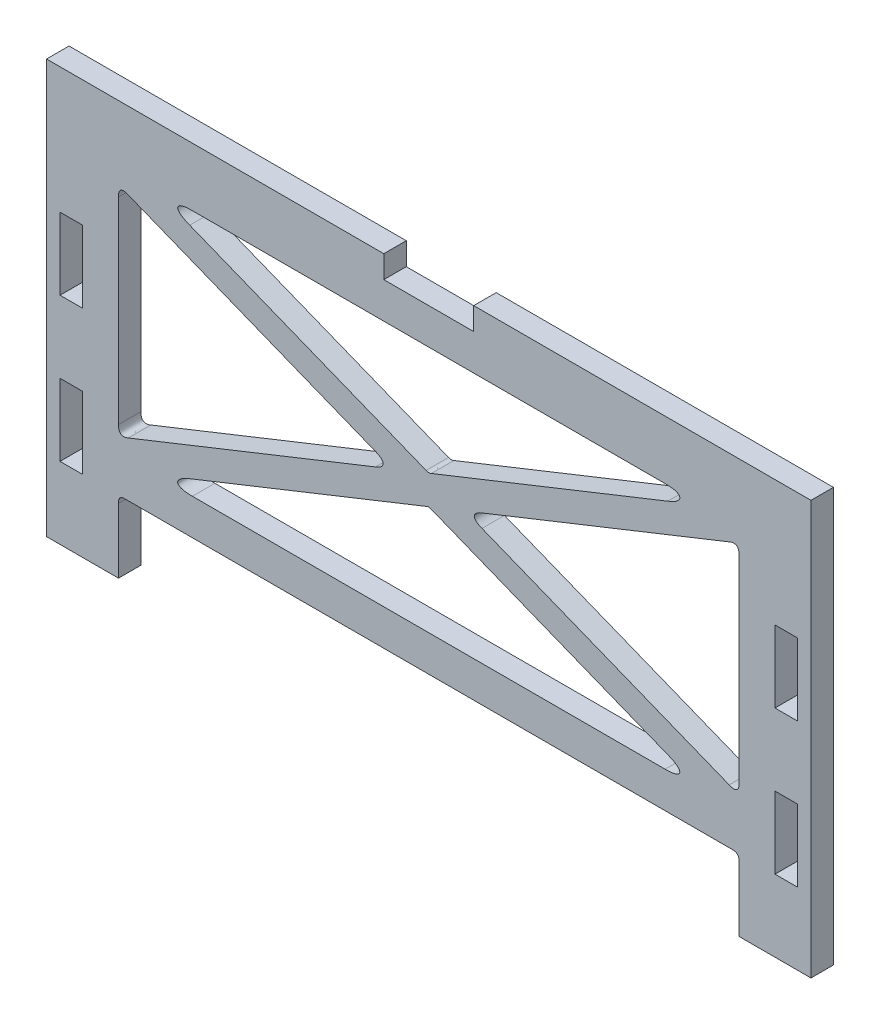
ISO-10303-21;
HEADER;
FILE_DESCRIPTION(('STEP AP214'),'2;1');
FILE_NAME('part.step','',(''),(''),'','','');
FILE_SCHEMA(('AUTOMOTIVE_DESIGN { 1 0 10303 214 1 1 1 1 }'));
ENDSEC;
DATA;
#1=APPLICATION_CONTEXT('core data for automotive mechanical design processes');
#2=APPLICATION_PROTOCOL_DEFINITION('international standard','automotive_design',2000,#1);
#3=PRODUCT_CONTEXT('',#1,'mechanical');
#4=PRODUCT('Part','Part','',(#3));
#5=PRODUCT_RELATED_PRODUCT_CATEGORY('part','',(#4));
#6=PRODUCT_DEFINITION_FORMATION('','',#4);
#7=PRODUCT_DEFINITION_CONTEXT('part definition',#1,'design');
#8=PRODUCT_DEFINITION('design','',#6,#7);
#9=PRODUCT_DEFINITION_SHAPE('','',#8);
#10=(LENGTH_UNIT() NAMED_UNIT(*) SI_UNIT(.MILLI.,.METRE.));
#11=(NAMED_UNIT(*) PLANE_ANGLE_UNIT() SI_UNIT($,.RADIAN.));
#12=(NAMED_UNIT(*) SI_UNIT($,.STERADIAN.) SOLID_ANGLE_UNIT());
#13=UNCERTAINTY_MEASURE_WITH_UNIT(LENGTH_MEASURE(1.E-05),#10,'distance_accuracy_value','');
#14=(GEOMETRIC_REPRESENTATION_CONTEXT(3) GLOBAL_UNCERTAINTY_ASSIGNED_CONTEXT((#13)) GLOBAL_UNIT_ASSIGNED_CONTEXT((#10,
#11,#12)) REPRESENTATION_CONTEXT('',''));
#15=CARTESIAN_POINT('',(0.,0.,0.));
#16=DIRECTION('',(0.,0.,1.));
#17=DIRECTION('',(1.,0.,0.));
#18=AXIS2_PLACEMENT_3D('',#15,#16,#17);
#19=CARTESIAN_POINT('',(-42.5,0.,2.5));
#20=DIRECTION('',(0.,1.,0.));
#21=DIRECTION('',(0.,0.,1.));
#22=AXIS2_PLACEMENT_3D('',#19,#20,#21);
#23=PLANE('',#22);
#24=DIRECTION('',(1.,0.,0.));
#25=VECTOR('',#24,1.);
#26=CARTESIAN_POINT('',(-42.5,0.,2.5));
#27=LINE('',#26,#25);
#28=CARTESIAN_POINT('',(34.5,0.,2.5));
#29=VERTEX_POINT('',#28);
#30=CARTESIAN_POINT('',(42.5,0.,2.5));
#31=VERTEX_POINT('',#30);
#32=EDGE_CURVE('E405',#29,#31,#27,.T.);
#33=ORIENTED_EDGE('',*,*,#32,.F.);
#34=DIRECTION('',(0.,0.,1.));
#35=VECTOR('',#34,1.);
#36=CARTESIAN_POINT('',(34.5,0.,-69.462219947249));
#37=LINE('',#36,#35);
#38=CARTESIAN_POINT('',(34.5,0.,0.));
#39=VERTEX_POINT('',#38);
#40=EDGE_CURVE('E391',#39,#29,#37,.T.);
#41=ORIENTED_EDGE('',*,*,#40,.F.);
#42=DIRECTION('',(1.,0.,0.));
#43=VECTOR('',#42,1.);
#44=CARTESIAN_POINT('',(-42.5,0.,0.));
#45=LINE('',#44,#43);
#46=CARTESIAN_POINT('',(42.5,0.,0.));
#47=VERTEX_POINT('',#46);
#48=EDGE_CURVE('E403',#39,#47,#45,.T.);
#49=ORIENTED_EDGE('',*,*,#48,.T.);
#50=DIRECTION('',(0.,0.,-1.));
#51=VECTOR('',#50,1.);
#52=CARTESIAN_POINT('',(42.5,0.,2.5));
#53=LINE('',#52,#51);
#54=EDGE_CURVE('E435',#31,#47,#53,.T.);
#55=ORIENTED_EDGE('',*,*,#54,.F.);
#56=EDGE_LOOP('',(#33,#41,#49,#55));
#57=FACE_BOUND('',#56,.T.);
#58=ADVANCED_FACE('F38',(#57),#23,.F.);
#59=CARTESIAN_POINT('',(-42.5,46.,2.5));
#60=DIRECTION('',(0.,-1.,0.));
#61=DIRECTION('',(0.,0.,-1.));
#62=AXIS2_PLACEMENT_3D('',#59,#60,#61);
#63=PLANE('',#62);
#64=DIRECTION('',(-1.,0.,0.));
#65=VECTOR('',#64,1.);
#66=CARTESIAN_POINT('',(-42.5,46.,0.));
#67=LINE('',#66,#65);
#68=CARTESIAN_POINT('',(42.5,46.,0.));
#69=VERTEX_POINT('',#68);
#70=CARTESIAN_POINT('',(5.,46.,0.));
#71=VERTEX_POINT('',#70);
#72=EDGE_CURVE('E424',#69,#71,#67,.T.);
#73=ORIENTED_EDGE('',*,*,#72,.T.);
#74=DIRECTION('',(0.,0.,1.));
#75=VECTOR('',#74,1.);
#76=CARTESIAN_POINT('',(5.,46.,-10.3077640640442));
#77=LINE('',#76,#75);
#78=CARTESIAN_POINT('',(5.,46.,2.5));
#79=VERTEX_POINT('',#78);
#80=EDGE_CURVE('E555',#71,#79,#77,.T.);
#81=ORIENTED_EDGE('',*,*,#80,.T.);
#82=DIRECTION('',(-1.,0.,0.));
#83=VECTOR('',#82,1.);
#84=CARTESIAN_POINT('',(-42.5,46.,2.5));
#85=LINE('',#84,#83);
#86=CARTESIAN_POINT('',(42.5,46.,2.5));
#87=VERTEX_POINT('',#86);
#88=EDGE_CURVE('E432',#87,#79,#85,.T.);
#89=ORIENTED_EDGE('',*,*,#88,.F.);
#90=DIRECTION('',(0.,0.,-1.));
#91=VECTOR('',#90,1.);
#92=CARTESIAN_POINT('',(42.5,46.,2.5));
#93=LINE('',#92,#91);
#94=EDGE_CURVE('E431',#87,#69,#93,.T.);
#95=ORIENTED_EDGE('',*,*,#94,.T.);
#96=EDGE_LOOP('',(#73,#81,#89,#95));
#97=FACE_BOUND('',#96,.T.);
#98=ADVANCED_FACE('F1546',(#97),#63,.F.);
#99=CARTESIAN_POINT('',(-42.5,0.,2.5));
#100=DIRECTION('',(1.,0.,0.));
#101=DIRECTION('',(0.,0.,-1.));
#102=AXIS2_PLACEMENT_3D('',#99,#100,#101);
#103=PLANE('',#102);
#104=DIRECTION('',(0.,-1.,0.));
#105=VECTOR('',#104,1.);
#106=CARTESIAN_POINT('',(-42.5,0.,0.));
#107=LINE('',#106,#105);
#108=CARTESIAN_POINT('',(-42.5,46.,0.));
#109=VERTEX_POINT('',#108);
#110=CARTESIAN_POINT('',(-42.5,0.,0.));
#111=VERTEX_POINT('',#110);
#112=EDGE_CURVE('E414',#109,#111,#107,.T.);
#113=ORIENTED_EDGE('',*,*,#112,.T.);
#114=DIRECTION('',(0.,0.,-1.));
#115=VECTOR('',#114,1.);
#116=CARTESIAN_POINT('',(-42.5,0.,2.5));
#117=LINE('',#116,#115);
#118=CARTESIAN_POINT('',(-42.5,0.,2.5));
#119=VERTEX_POINT('',#118);
#120=EDGE_CURVE('E437',#119,#111,#117,.T.);
#121=ORIENTED_EDGE('',*,*,#120,.F.);
#122=DIRECTION('',(0.,-1.,0.));
#123=VECTOR('',#122,1.);
#124=CARTESIAN_POINT('',(-42.5,0.,2.5));
#125=LINE('',#124,#123);
#126=CARTESIAN_POINT('',(-42.5,46.,2.5));
#127=VERTEX_POINT('',#126);
#128=EDGE_CURVE('E427',#127,#119,#125,.T.);
#129=ORIENTED_EDGE('',*,*,#128,.F.);
#130=DIRECTION('',(0.,0.,-1.));
#131=VECTOR('',#130,1.);
#132=CARTESIAN_POINT('',(-42.5,46.,2.5));
#133=LINE('',#132,#131);
#134=EDGE_CURVE('E428',#127,#109,#133,.T.);
#135=ORIENTED_EDGE('',*,*,#134,.T.);
#136=EDGE_LOOP('',(#113,#121,#129,#135));
#137=FACE_BOUND('',#136,.T.);
#138=ADVANCED_FACE('F713',(#137),#103,.F.);
#139=CARTESIAN_POINT('',(-34.5,0.,0.));
#140=VERTEX_POINT('',#139);
#141=EDGE_CURVE('E413',#111,#140,#45,.T.);
#142=ORIENTED_EDGE('',*,*,#141,.T.);
#143=DIRECTION('',(0.,0.,1.));
#144=VECTOR('',#143,1.);
#145=CARTESIAN_POINT('',(-34.5,0.,-69.462219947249));
#146=LINE('',#145,#144);
#147=CARTESIAN_POINT('',(-34.5,0.,2.5));
#148=VERTEX_POINT('',#147);
#149=EDGE_CURVE('E531',#140,#148,#146,.T.);
#150=ORIENTED_EDGE('',*,*,#149,.T.);
#151=EDGE_CURVE('E690',#119,#148,#27,.T.);
#152=ORIENTED_EDGE('',*,*,#151,.F.);
#153=ORIENTED_EDGE('',*,*,#120,.T.);
#154=EDGE_LOOP('',(#142,#150,#152,#153));
#155=FACE_BOUND('',#154,.T.);
#156=ADVANCED_FACE('F715',(#155),#23,.F.);
#157=CARTESIAN_POINT('',(42.5,0.,2.5));
#158=DIRECTION('',(-1.,0.,0.));
#159=DIRECTION('',(0.,0.,1.));
#160=AXIS2_PLACEMENT_3D('',#157,#158,#159);
#161=PLANE('',#160);
#162=DIRECTION('',(0.,1.,0.));
#163=VECTOR('',#162,1.);
#164=CARTESIAN_POINT('',(42.5,0.,0.));
#165=LINE('',#164,#163);
#166=EDGE_CURVE('E412',#47,#69,#165,.T.);
#167=ORIENTED_EDGE('',*,*,#166,.T.);
#168=ORIENTED_EDGE('',*,*,#94,.F.);
#169=DIRECTION('',(0.,1.,0.));
#170=VECTOR('',#169,1.);
#171=CARTESIAN_POINT('',(42.5,0.,2.5));
#172=LINE('',#171,#170);
#173=EDGE_CURVE('E693',#31,#87,#172,.T.);
#174=ORIENTED_EDGE('',*,*,#173,.F.);
#175=ORIENTED_EDGE('',*,*,#54,.T.);
#176=EDGE_LOOP('',(#167,#168,#174,#175));
#177=FACE_BOUND('',#176,.T.);
#178=ADVANCED_FACE('F1554',(#177),#161,.F.);
#179=CARTESIAN_POINT('',(-5.,46.,2.5));
#180=VERTEX_POINT('',#179);
#181=EDGE_CURVE('E694',#180,#127,#85,.T.);
#182=ORIENTED_EDGE('',*,*,#181,.F.);
#183=DIRECTION('',(0.,0.,1.));
#184=VECTOR('',#183,1.);
#185=CARTESIAN_POINT('',(-5.,46.,-10.3077640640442));
#186=LINE('',#185,#184);
#187=CARTESIAN_POINT('',(-5.,46.,0.));
#188=VERTEX_POINT('',#187);
#189=EDGE_CURVE('E551',#188,#180,#186,.T.);
#190=ORIENTED_EDGE('',*,*,#189,.F.);
#191=EDGE_CURVE('E423',#188,#109,#67,.T.);
#192=ORIENTED_EDGE('',*,*,#191,.T.);
#193=ORIENTED_EDGE('',*,*,#134,.F.);
#194=EDGE_LOOP('',(#182,#190,#192,#193));
#195=FACE_BOUND('',#194,.T.);
#196=ADVANCED_FACE('F709',(#195),#63,.F.);
#197=CARTESIAN_POINT('',(0.,0.,2.5));
#198=DIRECTION('',(0.,0.,-1.));
#199=DIRECTION('',(-1.,0.,0.));
#200=AXIS2_PLACEMENT_3D('',#197,#198,#199);
#201=PLANE('',#200);
#202=DIRECTION('',(-0.928940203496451,-0.370229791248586,0.));
#203=VECTOR('',#202,1.);
#204=CARTESIAN_POINT('',(4.05153781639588,25.75,2.5));
#205=LINE('',#204,#203);
#206=CARTESIAN_POINT('',(33.4038161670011,37.4483718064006,2.5));
#207=VERTEX_POINT('',#206);
#208=CARTESIAN_POINT('',(5.91617415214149,26.4931521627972,2.5));
#209=VERTEX_POINT('',#208);
#210=EDGE_CURVE('E1117',#207,#209,#205,.T.);
#211=ORIENTED_EDGE('',*,*,#210,.F.);
#212=CARTESIAN_POINT('',(34.5,36.7052196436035,2.5));
#213=CARTESIAN_POINT('',(34.5,36.8891580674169,2.5));
#214=CARTESIAN_POINT('',(34.5,37.0730964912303,2.5));
#215=CARTESIAN_POINT('',(34.4003997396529,37.4676216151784,2.5));
#216=CARTESIAN_POINT('',(34.1489169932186,37.6381130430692,2.5));
#217=CARTESIAN_POINT('',(33.7455517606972,37.5845707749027,2.5));
#218=CARTESIAN_POINT('',(33.5746839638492,37.5164712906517,2.5));
#219=CARTESIAN_POINT('',(33.4038161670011,37.4483718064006,2.5));
#220=B_SPLINE_CURVE_WITH_KNOTS('',5,(#212,#213,#214,#215,#216,#217,#218,#219),.UNSPECIFIED.,.F.,
.F.,(6,2,6),(0.,0.5,1.),.UNSPECIFIED.);
#221=CARTESIAN_POINT('',(34.5,36.7052196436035,2.5));
#222=VERTEX_POINT('',#221);
#223=EDGE_CURVE('E979',#207,#222,#220,.F.);
#224=ORIENTED_EDGE('',*,*,#223,.T.);
#225=DIRECTION('',(0.,1.,0.));
#226=VECTOR('',#225,1.);
#227=CARTESIAN_POINT('',(34.5,37.8852566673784,2.5));
#228=LINE('',#227,#226);
#229=CARTESIAN_POINT('',(34.5,14.7947803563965,2.5));
#230=VERTEX_POINT('',#229);
#231=EDGE_CURVE('E1105',#230,#222,#228,.T.);
#232=ORIENTED_EDGE('',*,*,#231,.F.);
#233=CARTESIAN_POINT('',(33.4038161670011,14.0516281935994,2.5));
#234=CARTESIAN_POINT('',(33.5746839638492,13.9835287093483,2.5));
#235=CARTESIAN_POINT('',(33.7455517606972,13.9154292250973,2.5));
#236=CARTESIAN_POINT('',(34.1489169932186,13.8618869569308,2.5));
#237=CARTESIAN_POINT('',(34.4003997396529,14.0323783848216,2.5));
#238=CARTESIAN_POINT('',(34.5,14.4269035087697,2.5));
#239=CARTESIAN_POINT('',(34.5,14.6108419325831,2.5));
#240=CARTESIAN_POINT('',(34.5,14.7947803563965,2.5));
#241=B_SPLINE_CURVE_WITH_KNOTS('',5,(#233,#234,#235,#236,#237,#238,#239,#240),.UNSPECIFIED.,.F.,
.F.,(6,2,6),(0.,0.5,1.),.UNSPECIFIED.);
#242=CARTESIAN_POINT('',(33.4038161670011,14.0516281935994,2.5));
#243=VERTEX_POINT('',#242);
#244=EDGE_CURVE('E941',#230,#243,#241,.F.);
#245=ORIENTED_EDGE('',*,*,#244,.T.);
#246=DIRECTION('',(0.928940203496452,-0.370229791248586,0.));
#247=VECTOR('',#246,1.);
#248=CARTESIAN_POINT('',(34.5,13.6147433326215,2.5));
#249=LINE('',#248,#247);
#250=CARTESIAN_POINT('',(5.91617415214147,25.0068478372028,2.5));
#251=VERTEX_POINT('',#250);
#252=EDGE_CURVE('E1104',#251,#243,#249,.T.);
#253=ORIENTED_EDGE('',*,*,#252,.F.);
#254=CARTESIAN_POINT('',(5.91617415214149,26.4931521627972,2.5));
#255=CARTESIAN_POINT('',(5.66296778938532,26.3922365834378,2.5));
#256=CARTESIAN_POINT('',(5.40976142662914,26.2913210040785,2.5));
#257=CARTESIAN_POINT('',(4.95961678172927,25.9304403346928,2.5));
#258=CARTESIAN_POINT('',(4.95961678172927,25.5695596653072,2.5));
#259=CARTESIAN_POINT('',(5.40976142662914,25.2086789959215,2.5));
#260=CARTESIAN_POINT('',(5.66296778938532,25.1077634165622,2.5));
#261=CARTESIAN_POINT('',(5.91617415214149,25.0068478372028,2.5));
#262=B_SPLINE_CURVE_WITH_KNOTS('',5,(#254,#255,#256,#257,#258,#259,#260,#261),.UNSPECIFIED.,.F.,
.F.,(6,2,6),(0.,0.5,1.),.UNSPECIFIED.);
#263=EDGE_CURVE('E970',#251,#209,#262,.F.);
#264=ORIENTED_EDGE('',*,*,#263,.T.);
#265=EDGE_LOOP('',(#211,#224,#232,#245,#253,#264));
#266=FACE_BOUND('',#265,.T.);
#267=DIRECTION('',(-0.928940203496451,-0.370229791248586,0.));
#268=VECTOR('',#267,1.);
#269=CARTESIAN_POINT('',(-30.4484621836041,12.,2.5));
#270=LINE('',#269,#268);
#271=CARTESIAN_POINT('',(-0.29618383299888,24.0172123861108,2.5));
#272=VERTEX_POINT('',#271);
#273=CARTESIAN_POINT('',(-26.5765531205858,13.5431521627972,2.5));
#274=VERTEX_POINT('',#273);
#275=EDGE_CURVE('E463',#272,#274,#270,.T.);
#276=ORIENTED_EDGE('',*,*,#275,.F.);
#277=CARTESIAN_POINT('',(0.296183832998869,24.0172123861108,2.5));
#278=CARTESIAN_POINT('',(0.24187685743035,24.0388564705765,2.5));
#279=CARTESIAN_POINT('',(0.187569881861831,24.0605005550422,2.5));
#280=CARTESIAN_POINT('',(0.0625232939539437,24.0989789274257,2.5));
#281=CARTESIAN_POINT('',(-0.0625232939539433,24.0989789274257,2.5));
#282=CARTESIAN_POINT('',(-0.187569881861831,24.0605005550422,2.5));
#283=CARTESIAN_POINT('',(-0.24187685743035,24.0388564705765,2.5));
#284=CARTESIAN_POINT('',(-0.296183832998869,24.0172123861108,2.5));
#285=B_SPLINE_CURVE_WITH_KNOTS('',5,(#277,#278,#279,#280,#281,#282,#283,#284),.UNSPECIFIED.,.F.,
.F.,(6,2,6),(0.,0.5,1.),.UNSPECIFIED.);
#286=CARTESIAN_POINT('',(0.296183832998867,24.0172123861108,2.5));
#287=VERTEX_POINT('',#286);
#288=EDGE_CURVE('E948',#272,#287,#285,.F.);
#289=ORIENTED_EDGE('',*,*,#288,.T.);
#290=DIRECTION('',(-0.928940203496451,0.370229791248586,0.));
#291=VECTOR('',#290,1.);
#292=CARTESIAN_POINT('',(0.,24.1352566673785,2.5));
#293=LINE('',#292,#291);
#294=CARTESIAN_POINT('',(26.5765531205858,13.5431521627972,2.5));
#295=VERTEX_POINT('',#294);
#296=EDGE_CURVE('E445',#295,#287,#293,.T.);
#297=ORIENTED_EDGE('',*,*,#296,.F.);
#298=CARTESIAN_POINT('',(26.2803692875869,12.,2.5));
#299=CARTESIAN_POINT('',(26.7417135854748,12.,2.5));
#300=CARTESIAN_POINT('',(27.2030578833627,12.,2.5));
#301=CARTESIAN_POINT('',(28.0709576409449,12.2486898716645,2.5));
#302=CARTESIAN_POINT('',(28.1478302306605,12.6492049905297,2.5));
#303=CARTESIAN_POINT('',(27.4336756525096,13.2015453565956,2.5));
#304=CARTESIAN_POINT('',(27.0051143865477,13.3723487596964,2.5));
#305=CARTESIAN_POINT('',(26.5765531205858,13.5431521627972,2.5));
#306=B_SPLINE_CURVE_WITH_KNOTS('',5,(#298,#299,#300,#301,#302,#303,#304,#305),.UNSPECIFIED.,.F.,
.F.,(6,2,6),(0.,0.5,1.),.UNSPECIFIED.);
#307=CARTESIAN_POINT('',(26.2803692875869,12.,2.5));
#308=VERTEX_POINT('',#307);
#309=EDGE_CURVE('E879',#295,#308,#306,.F.);
#310=ORIENTED_EDGE('',*,*,#309,.T.);
#311=DIRECTION('',(1.,0.,0.));
#312=VECTOR('',#311,1.);
#313=CARTESIAN_POINT('',(30.4484621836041,12.,2.5));
#314=LINE('',#313,#312);
#315=CARTESIAN_POINT('',(-26.2803692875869,12.,2.5));
#316=VERTEX_POINT('',#315);
#317=EDGE_CURVE('E441',#316,#308,#314,.T.);
#318=ORIENTED_EDGE('',*,*,#317,.F.);
#319=CARTESIAN_POINT('',(-26.5765531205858,13.5431521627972,2.5));
#320=CARTESIAN_POINT('',(-27.0051143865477,13.3723487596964,2.5));
#321=CARTESIAN_POINT('',(-27.4336756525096,13.2015453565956,2.5));
#322=CARTESIAN_POINT('',(-28.1478302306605,12.6492049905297,2.5));
#323=CARTESIAN_POINT('',(-28.0709576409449,12.2486898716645,2.5));
#324=CARTESIAN_POINT('',(-27.2030578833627,12.,2.5));
#325=CARTESIAN_POINT('',(-26.7417135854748,12.,2.5));
#326=CARTESIAN_POINT('',(-26.2803692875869,12.,2.5));
#327=B_SPLINE_CURVE_WITH_KNOTS('',5,(#319,#320,#321,#322,#323,#324,#325,#326),.UNSPECIFIED.,.F.,
.F.,(6,2,6),(0.,0.5,1.),.UNSPECIFIED.);
#328=EDGE_CURVE('E1024',#316,#274,#327,.F.);
#329=ORIENTED_EDGE('',*,*,#328,.T.);
#330=EDGE_LOOP('',(#276,#289,#297,#310,#318,#329));
#331=FACE_BOUND('',#330,.T.);
#332=DIRECTION('',(0.928940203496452,0.370229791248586,0.));
#333=VECTOR('',#332,1.);
#334=CARTESIAN_POINT('',(-34.5,13.6147433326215,2.5));
#335=LINE('',#334,#333);
#336=CARTESIAN_POINT('',(-33.4038161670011,14.0516281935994,2.5));
#337=VERTEX_POINT('',#336);
#338=CARTESIAN_POINT('',(-5.91617415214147,25.0068478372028,2.5));
#339=VERTEX_POINT('',#338);
#340=EDGE_CURVE('E1162',#337,#339,#335,.T.);
#341=ORIENTED_EDGE('',*,*,#340,.F.);
#342=CARTESIAN_POINT('',(-34.5,14.7947803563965,2.5));
#343=CARTESIAN_POINT('',(-34.5,14.6108419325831,2.5));
#344=CARTESIAN_POINT('',(-34.5,14.4269035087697,2.5));
#345=CARTESIAN_POINT('',(-34.4003997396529,14.0323783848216,2.5));
#346=CARTESIAN_POINT('',(-34.1489169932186,13.8618869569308,2.5));
#347=CARTESIAN_POINT('',(-33.7455517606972,13.9154292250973,2.5));
#348=CARTESIAN_POINT('',(-33.5746839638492,13.9835287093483,2.5));
#349=CARTESIAN_POINT('',(-33.4038161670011,14.0516281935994,2.5));
#350=B_SPLINE_CURVE_WITH_KNOTS('',5,(#342,#343,#344,#345,#346,#347,#348,#349),.UNSPECIFIED.,.F.,
.F.,(6,2,6),(0.,0.5,1.),.UNSPECIFIED.);
#351=CARTESIAN_POINT('',(-34.5,14.7947803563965,2.5));
#352=VERTEX_POINT('',#351);
#353=EDGE_CURVE('E52',#337,#352,#350,.F.);
#354=ORIENTED_EDGE('',*,*,#353,.T.);
#355=DIRECTION('',(0.,-1.,0.));
#356=VECTOR('',#355,1.);
#357=CARTESIAN_POINT('',(-34.5,37.8852566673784,2.5));
#358=LINE('',#357,#356);
#359=CARTESIAN_POINT('',(-34.5,36.7052196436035,2.5));
#360=VERTEX_POINT('',#359);
#361=EDGE_CURVE('E1166',#360,#352,#358,.T.);
#362=ORIENTED_EDGE('',*,*,#361,.F.);
#363=CARTESIAN_POINT('',(-33.4038161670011,37.4483718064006,2.5));
#364=CARTESIAN_POINT('',(-33.5746839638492,37.5164712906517,2.5));
#365=CARTESIAN_POINT('',(-33.7455517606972,37.5845707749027,2.5));
#366=CARTESIAN_POINT('',(-34.1489169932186,37.6381130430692,2.5));
#367=CARTESIAN_POINT('',(-34.4003997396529,37.4676216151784,2.5));
#368=CARTESIAN_POINT('',(-34.5,37.0730964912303,2.5));
#369=CARTESIAN_POINT('',(-34.5,36.8891580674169,2.5));
#370=CARTESIAN_POINT('',(-34.5,36.7052196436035,2.5));
#371=B_SPLINE_CURVE_WITH_KNOTS('',5,(#363,#364,#365,#366,#367,#368,#369,#370),.UNSPECIFIED.,.F.,
.F.,(6,2,6),(0.,0.5,1.),.UNSPECIFIED.);
#372=CARTESIAN_POINT('',(-33.4038161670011,37.4483718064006,2.5));
#373=VERTEX_POINT('',#372);
#374=EDGE_CURVE('E999',#360,#373,#371,.F.);
#375=ORIENTED_EDGE('',*,*,#374,.T.);
#376=DIRECTION('',(-0.928940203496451,0.370229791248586,0.));
#377=VECTOR('',#376,1.);
#378=CARTESIAN_POINT('',(-4.05153781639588,25.75,2.5));
#379=LINE('',#378,#377);
#380=CARTESIAN_POINT('',(-5.91617415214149,26.4931521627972,2.5));
#381=VERTEX_POINT('',#380);
#382=EDGE_CURVE('E1216',#381,#373,#379,.T.);
#383=ORIENTED_EDGE('',*,*,#382,.F.);
#384=CARTESIAN_POINT('',(-5.91617415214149,25.0068478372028,2.5));
#385=CARTESIAN_POINT('',(-5.66296778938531,25.1077634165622,2.5));
#386=CARTESIAN_POINT('',(-5.40976142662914,25.2086789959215,2.5));
#387=CARTESIAN_POINT('',(-4.95961678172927,25.5695596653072,2.5));
#388=CARTESIAN_POINT('',(-4.95961678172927,25.9304403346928,2.5));
#389=CARTESIAN_POINT('',(-5.40976142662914,26.2913210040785,2.5));
#390=CARTESIAN_POINT('',(-5.66296778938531,26.3922365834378,2.5));
#391=CARTESIAN_POINT('',(-5.91617415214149,26.4931521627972,2.5));
#392=B_SPLINE_CURVE_WITH_KNOTS('',5,(#384,#385,#386,#387,#388,#389,#390,#391),.UNSPECIFIED.,.F.,
.F.,(6,2,6),(0.,0.5,1.),.UNSPECIFIED.);
#393=EDGE_CURVE('E958',#381,#339,#392,.F.);
#394=ORIENTED_EDGE('',*,*,#393,.T.);
#395=EDGE_LOOP('',(#341,#354,#362,#375,#383,#394));
#396=FACE_BOUND('',#395,.T.);
#397=DIRECTION('',(0.928940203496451,0.370229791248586,0.));
#398=VECTOR('',#397,1.);
#399=CARTESIAN_POINT('',(30.4484621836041,39.5,2.5));
#400=LINE('',#399,#398);
#401=CARTESIAN_POINT('',(0.296183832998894,27.4827876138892,2.5));
#402=VERTEX_POINT('',#401);
#403=CARTESIAN_POINT('',(26.5765531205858,37.9568478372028,2.5));
#404=VERTEX_POINT('',#403);
#405=EDGE_CURVE('E1140',#402,#404,#400,.T.);
#406=ORIENTED_EDGE('',*,*,#405,.F.);
#407=CARTESIAN_POINT('',(-0.296183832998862,27.4827876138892,2.5));
#408=CARTESIAN_POINT('',(-0.241876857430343,27.4611435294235,2.5));
#409=CARTESIAN_POINT('',(-0.187569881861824,27.4394994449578,2.5));
#410=CARTESIAN_POINT('',(-0.0625232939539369,27.4010210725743,2.5));
#411=CARTESIAN_POINT('',(0.0625232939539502,27.4010210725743,2.5));
#412=CARTESIAN_POINT('',(0.187569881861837,27.4394994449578,2.5));
#413=CARTESIAN_POINT('',(0.241876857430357,27.4611435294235,2.5));
#414=CARTESIAN_POINT('',(0.296183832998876,27.4827876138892,2.5));
#415=B_SPLINE_CURVE_WITH_KNOTS('',5,(#407,#408,#409,#410,#411,#412,#413,#414),.UNSPECIFIED.,.F.,
.F.,(6,2,6),(0.,0.5,1.),.UNSPECIFIED.);
#416=CARTESIAN_POINT('',(-0.296183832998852,27.4827876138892,2.5));
#417=VERTEX_POINT('',#416);
#418=EDGE_CURVE('E1017',#402,#417,#415,.F.);
#419=ORIENTED_EDGE('',*,*,#418,.T.);
#420=DIRECTION('',(0.928940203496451,-0.370229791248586,0.));
#421=VECTOR('',#420,1.);
#422=CARTESIAN_POINT('',(-30.4484621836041,39.5,2.5));
#423=LINE('',#422,#421);
#424=CARTESIAN_POINT('',(-26.5765531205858,37.9568478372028,2.5));
#425=VERTEX_POINT('',#424);
#426=EDGE_CURVE('E1144',#425,#417,#423,.T.);
#427=ORIENTED_EDGE('',*,*,#426,.F.);
#428=CARTESIAN_POINT('',(-26.2803692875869,39.5,2.5));
#429=CARTESIAN_POINT('',(-26.7417135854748,39.5,2.5));
#430=CARTESIAN_POINT('',(-27.2030578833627,39.5,2.5));
#431=CARTESIAN_POINT('',(-28.0709576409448,39.2513101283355,2.5));
#432=CARTESIAN_POINT('',(-28.1478302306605,38.8507950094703,2.5));
#433=CARTESIAN_POINT('',(-27.4336756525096,38.2984546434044,2.5));
#434=CARTESIAN_POINT('',(-27.0051143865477,38.1276512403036,2.5));
#435=CARTESIAN_POINT('',(-26.5765531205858,37.9568478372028,2.5));
#436=B_SPLINE_CURVE_WITH_KNOTS('',5,(#428,#429,#430,#431,#432,#433,#434,#435),.UNSPECIFIED.,.F.,
.F.,(6,2,6),(0.,0.5,1.),.UNSPECIFIED.);
#437=CARTESIAN_POINT('',(-26.2803692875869,39.5,2.5));
#438=VERTEX_POINT('',#437);
#439=EDGE_CURVE('E1008',#425,#438,#436,.F.);
#440=ORIENTED_EDGE('',*,*,#439,.T.);
#441=DIRECTION('',(-1.,0.,0.));
#442=VECTOR('',#441,1.);
#443=CARTESIAN_POINT('',(-30.4484621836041,39.5,2.5));
#444=LINE('',#443,#442);
#445=CARTESIAN_POINT('',(26.2803692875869,39.5,2.5));
#446=VERTEX_POINT('',#445);
#447=EDGE_CURVE('E1527',#446,#438,#444,.T.);
#448=ORIENTED_EDGE('',*,*,#447,.F.);
#449=CARTESIAN_POINT('',(26.5765531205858,37.9568478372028,2.5));
#450=CARTESIAN_POINT('',(27.0051143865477,38.1276512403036,2.5));
#451=CARTESIAN_POINT('',(27.4336756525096,38.2984546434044,2.5));
#452=CARTESIAN_POINT('',(28.1478302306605,38.8507950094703,2.5));
#453=CARTESIAN_POINT('',(28.0709576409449,39.2513101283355,2.5));
#454=CARTESIAN_POINT('',(27.2030578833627,39.5,2.5));
#455=CARTESIAN_POINT('',(26.7417135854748,39.5,2.5));
#456=CARTESIAN_POINT('',(26.2803692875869,39.5,2.5));
#457=B_SPLINE_CURVE_WITH_KNOTS('',5,(#449,#450,#451,#452,#453,#454,#455,#456),.UNSPECIFIED.,.F.,
.F.,(6,2,6),(0.,0.5,1.),.UNSPECIFIED.);
#458=EDGE_CURVE('E986',#446,#404,#457,.F.);
#459=ORIENTED_EDGE('',*,*,#458,.T.);
#460=EDGE_LOOP('',(#406,#419,#427,#440,#448,#459));
#461=FACE_BOUND('',#460,.T.);
#462=DIRECTION('',(0.,1.,0.));
#463=VECTOR('',#462,1.);
#464=CARTESIAN_POINT('',(41.,16.,2.5));
#465=LINE('',#464,#463);
#466=CARTESIAN_POINT('',(41.,8.,2.5));
#467=VERTEX_POINT('',#466);
#468=CARTESIAN_POINT('',(41.,16.,2.5));
#469=VERTEX_POINT('',#468);
#470=EDGE_CURVE('E565',#467,#469,#465,.T.);
#471=ORIENTED_EDGE('',*,*,#470,.F.);
#472=DIRECTION('',(1.,0.,0.));
#473=VECTOR('',#472,1.);
#474=CARTESIAN_POINT('',(38.5,8.,2.5));
#475=LINE('',#474,#473);
#476=CARTESIAN_POINT('',(38.5,8.,2.5));
#477=VERTEX_POINT('',#476);
#478=EDGE_CURVE('E568',#477,#467,#475,.T.);
#479=ORIENTED_EDGE('',*,*,#478,.F.);
#480=DIRECTION('',(0.,-1.,0.));
#481=VECTOR('',#480,1.);
#482=CARTESIAN_POINT('',(38.5,16.,2.5));
#483=LINE('',#482,#481);
#484=CARTESIAN_POINT('',(38.5,16.,2.5));
#485=VERTEX_POINT('',#484);
#486=EDGE_CURVE('E571',#485,#477,#483,.T.);
#487=ORIENTED_EDGE('',*,*,#486,.F.);
#488=DIRECTION('',(-1.,0.,0.));
#489=VECTOR('',#488,1.);
#490=CARTESIAN_POINT('',(38.5,16.,2.5));
#491=LINE('',#490,#489);
#492=EDGE_CURVE('E562',#469,#485,#491,.T.);
#493=ORIENTED_EDGE('',*,*,#492,.F.);
#494=EDGE_LOOP('',(#471,#479,#487,#493));
#495=FACE_BOUND('',#494,.T.);
#496=DIRECTION('',(1.,0.,0.));
#497=VECTOR('',#496,1.);
#498=CARTESIAN_POINT('',(-38.5,8.,2.5));
#499=LINE('',#498,#497);
#500=CARTESIAN_POINT('',(-41.,8.,2.5));
#501=VERTEX_POINT('',#500);
#502=CARTESIAN_POINT('',(-38.5,8.,2.5));
#503=VERTEX_POINT('',#502);
#504=EDGE_CURVE('E599',#501,#503,#499,.T.);
#505=ORIENTED_EDGE('',*,*,#504,.F.);
#506=DIRECTION('',(0.,-1.,0.));
#507=VECTOR('',#506,1.);
#508=CARTESIAN_POINT('',(-41.,16.,2.5));
#509=LINE('',#508,#507);
#510=CARTESIAN_POINT('',(-41.,16.,2.5));
#511=VERTEX_POINT('',#510);
#512=EDGE_CURVE('E602',#511,#501,#509,.T.);
#513=ORIENTED_EDGE('',*,*,#512,.F.);
#514=DIRECTION('',(-1.,0.,0.));
#515=VECTOR('',#514,1.);
#516=CARTESIAN_POINT('',(-38.5,16.,2.5));
#517=LINE('',#516,#515);
#518=CARTESIAN_POINT('',(-38.5,16.,2.5));
#519=VERTEX_POINT('',#518);
#520=EDGE_CURVE('E605',#519,#511,#517,.T.);
#521=ORIENTED_EDGE('',*,*,#520,.F.);
#522=DIRECTION('',(0.,1.,0.));
#523=VECTOR('',#522,1.);
#524=CARTESIAN_POINT('',(-38.5,16.,2.5));
#525=LINE('',#524,#523);
#526=EDGE_CURVE('E596',#503,#519,#525,.T.);
#527=ORIENTED_EDGE('',*,*,#526,.F.);
#528=EDGE_LOOP('',(#505,#513,#521,#527));
#529=FACE_BOUND('',#528,.T.);
#530=DIRECTION('',(1.,0.,0.));
#531=VECTOR('',#530,1.);
#532=CARTESIAN_POINT('',(-38.5,24.,2.5));
#533=LINE('',#532,#531);
#534=CARTESIAN_POINT('',(-41.,24.,2.5));
#535=VERTEX_POINT('',#534);
#536=CARTESIAN_POINT('',(-38.5,24.,2.5));
#537=VERTEX_POINT('',#536);
#538=EDGE_CURVE('E631',#535,#537,#533,.T.);
#539=ORIENTED_EDGE('',*,*,#538,.F.);
#540=DIRECTION('',(0.,-1.,0.));
#541=VECTOR('',#540,1.);
#542=CARTESIAN_POINT('',(-41.,32.,2.5));
#543=LINE('',#542,#541);
#544=CARTESIAN_POINT('',(-41.,32.,2.5));
#545=VERTEX_POINT('',#544);
#546=EDGE_CURVE('E634',#545,#535,#543,.T.);
#547=ORIENTED_EDGE('',*,*,#546,.F.);
#548=DIRECTION('',(-1.,0.,0.));
#549=VECTOR('',#548,1.);
#550=CARTESIAN_POINT('',(-38.5,32.,2.5));
#551=LINE('',#550,#549);
#552=CARTESIAN_POINT('',(-38.5,32.,2.5));
#553=VERTEX_POINT('',#552);
#554=EDGE_CURVE('E561',#553,#545,#551,.T.);
#555=ORIENTED_EDGE('',*,*,#554,.F.);
#556=DIRECTION('',(0.,1.,0.));
#557=VECTOR('',#556,1.);
#558=CARTESIAN_POINT('',(-38.5,32.,2.5));
#559=LINE('',#558,#557);
#560=EDGE_CURVE('E628',#537,#553,#559,.T.);
#561=ORIENTED_EDGE('',*,*,#560,.F.);
#562=EDGE_LOOP('',(#539,#547,#555,#561));
#563=FACE_BOUND('',#562,.T.);
#564=DIRECTION('',(0.,1.,0.));
#565=VECTOR('',#564,1.);
#566=CARTESIAN_POINT('',(41.,32.,2.5));
#567=LINE('',#566,#565);
#568=CARTESIAN_POINT('',(41.,24.,2.5));
#569=VERTEX_POINT('',#568);
#570=CARTESIAN_POINT('',(41.,32.,2.5));
#571=VERTEX_POINT('',#570);
#572=EDGE_CURVE('E661',#569,#571,#567,.T.);
#573=ORIENTED_EDGE('',*,*,#572,.F.);
#574=DIRECTION('',(1.,0.,0.));
#575=VECTOR('',#574,1.);
#576=CARTESIAN_POINT('',(38.5,24.,2.5));
#577=LINE('',#576,#575);
#578=CARTESIAN_POINT('',(38.5,24.,2.5));
#579=VERTEX_POINT('',#578);
#580=EDGE_CURVE('E664',#579,#569,#577,.T.);
#581=ORIENTED_EDGE('',*,*,#580,.F.);
#582=DIRECTION('',(0.,-1.,0.));
#583=VECTOR('',#582,1.);
#584=CARTESIAN_POINT('',(38.5,32.,2.5));
#585=LINE('',#584,#583);
#586=CARTESIAN_POINT('',(38.5,32.,2.5));
#587=VERTEX_POINT('',#586);
#588=EDGE_CURVE('E595',#587,#579,#585,.T.);
#589=ORIENTED_EDGE('',*,*,#588,.F.);
#590=DIRECTION('',(-1.,0.,0.));
#591=VECTOR('',#590,1.);
#592=CARTESIAN_POINT('',(38.5,32.,2.5));
#593=LINE('',#592,#591);
#594=EDGE_CURVE('E658',#571,#587,#593,.T.);
#595=ORIENTED_EDGE('',*,*,#594,.F.);
#596=EDGE_LOOP('',(#573,#581,#589,#595));
#597=FACE_BOUND('',#596,.T.);
#598=DIRECTION('',(-1.,0.,0.));
#599=VECTOR('',#598,1.);
#600=CARTESIAN_POINT('',(-34.5,8.,2.5));
#601=LINE('',#600,#599);
#602=CARTESIAN_POINT('',(33.7,8.,2.5));
#603=VERTEX_POINT('',#602);
#604=CARTESIAN_POINT('',(-33.7,8.,2.5));
#605=VERTEX_POINT('',#604);
#606=EDGE_CURVE('E406',#603,#605,#601,.T.);
#607=ORIENTED_EDGE('',*,*,#606,.F.);
#608=CARTESIAN_POINT('',(34.5,7.2,2.5));
#609=CARTESIAN_POINT('',(34.5,7.33455844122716,2.5));
#610=CARTESIAN_POINT('',(34.5,7.46911688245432,2.5));
#611=CARTESIAN_POINT('',(34.4426464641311,7.76568542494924,2.5));
#612=CARTESIAN_POINT('',(34.2656854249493,7.94264646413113,2.5));
#613=CARTESIAN_POINT('',(33.9691168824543,8.,2.5));
#614=CARTESIAN_POINT('',(33.8345584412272,8.,2.5));
#615=CARTESIAN_POINT('',(33.7,8.,2.5));
#616=B_SPLINE_CURVE_WITH_KNOTS('',5,(#608,#609,#610,#611,#612,#613,#614,#615),.UNSPECIFIED.,.F.,
.F.,(6,2,6),(0.,0.5,1.),.UNSPECIFIED.);
#617=CARTESIAN_POINT('',(34.5,7.2,2.5));
#618=VERTEX_POINT('',#617);
#619=EDGE_CURVE('E773',#603,#618,#616,.F.);
#620=ORIENTED_EDGE('',*,*,#619,.T.);
#621=DIRECTION('',(0.,1.,0.));
#622=VECTOR('',#621,1.);
#623=CARTESIAN_POINT('',(34.5,0.,2.5));
#624=LINE('',#623,#622);
#625=EDGE_CURVE('E507',#29,#618,#624,.T.);
#626=ORIENTED_EDGE('',*,*,#625,.F.);
#627=ORIENTED_EDGE('',*,*,#32,.T.);
#628=ORIENTED_EDGE('',*,*,#173,.T.);
#629=ORIENTED_EDGE('',*,*,#88,.T.);
#630=DIRECTION('',(0.,1.,0.));
#631=VECTOR('',#630,1.);
#632=CARTESIAN_POINT('',(5.,46.,2.5));
#633=LINE('',#632,#631);
#634=CARTESIAN_POINT('',(5.,43.5,2.5));
#635=VERTEX_POINT('',#634);
#636=EDGE_CURVE('E536',#635,#79,#633,.T.);
#637=ORIENTED_EDGE('',*,*,#636,.F.);
#638=DIRECTION('',(1.,0.,0.));
#639=VECTOR('',#638,1.);
#640=CARTESIAN_POINT('',(-5.,43.5,2.5));
#641=LINE('',#640,#639);
#642=CARTESIAN_POINT('',(-5.,43.5,2.5));
#643=VERTEX_POINT('',#642);
#644=EDGE_CURVE('E539',#643,#635,#641,.T.);
#645=ORIENTED_EDGE('',*,*,#644,.F.);
#646=DIRECTION('',(0.,-1.,0.));
#647=VECTOR('',#646,1.);
#648=CARTESIAN_POINT('',(-5.,46.,2.5));
#649=LINE('',#648,#647);
#650=EDGE_CURVE('E534',#180,#643,#649,.T.);
#651=ORIENTED_EDGE('',*,*,#650,.F.);
#652=ORIENTED_EDGE('',*,*,#181,.T.);
#653=ORIENTED_EDGE('',*,*,#128,.T.);
#654=ORIENTED_EDGE('',*,*,#151,.T.);
#655=DIRECTION('',(0.,-1.,0.));
#656=VECTOR('',#655,1.);
#657=CARTESIAN_POINT('',(-34.5,0.,2.5));
#658=LINE('',#657,#656);
#659=CARTESIAN_POINT('',(-34.5,7.2,2.5));
#660=VERTEX_POINT('',#659);
#661=EDGE_CURVE('E521',#660,#148,#658,.T.);
#662=ORIENTED_EDGE('',*,*,#661,.F.);
#663=CARTESIAN_POINT('',(-33.7,8.,2.5));
#664=CARTESIAN_POINT('',(-33.8345584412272,8.,2.5));
#665=CARTESIAN_POINT('',(-33.9691168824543,8.,2.5));
#666=CARTESIAN_POINT('',(-34.2656854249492,7.94264646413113,2.5));
#667=CARTESIAN_POINT('',(-34.4426464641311,7.76568542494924,2.5));
#668=CARTESIAN_POINT('',(-34.5,7.46911688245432,2.5));
#669=CARTESIAN_POINT('',(-34.5,7.33455844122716,2.5));
#670=CARTESIAN_POINT('',(-34.5,7.2,2.5));
#671=B_SPLINE_CURVE_WITH_KNOTS('',5,(#663,#664,#665,#666,#667,#668,#669,#670),.UNSPECIFIED.,.F.,
.F.,(6,2,6),(0.,0.5,1.),.UNSPECIFIED.);
#672=EDGE_CURVE('E68',#660,#605,#671,.F.);
#673=ORIENTED_EDGE('',*,*,#672,.T.);
#674=EDGE_LOOP('',(#607,#620,#626,#627,#628,#629,#637,#645,#651,#652,#653,#654,#662,#673));
#675=FACE_BOUND('',#674,.T.);
#676=ADVANCED_FACE('F703',(#266,#331,#396,#461,#495,#529,#563,#597,#675),#201,.F.);
#677=CARTESIAN_POINT('',(0.,0.,0.));
#678=DIRECTION('',(0.,0.,-1.));
#679=DIRECTION('',(-1.,0.,0.));
#680=AXIS2_PLACEMENT_3D('',#677,#678,#679);
#681=PLANE('',#680);
#682=DIRECTION('',(0.928940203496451,-0.370229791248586,0.));
#683=VECTOR('',#682,1.);
#684=CARTESIAN_POINT('',(34.5,13.6147433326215,0.));
#685=LINE('',#684,#683);
#686=CARTESIAN_POINT('',(5.91617415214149,25.0068478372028,0.));
#687=VERTEX_POINT('',#686);
#688=CARTESIAN_POINT('',(33.4038161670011,14.0516281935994,0.));
#689=VERTEX_POINT('',#688);
#690=EDGE_CURVE('E1128',#687,#689,#685,.T.);
#691=ORIENTED_EDGE('',*,*,#690,.T.);
#692=CARTESIAN_POINT('',(34.5,14.7947803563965,0.));
#693=CARTESIAN_POINT('',(34.5,14.6108419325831,0.));
#694=CARTESIAN_POINT('',(34.5,14.4269035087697,0.));
#695=CARTESIAN_POINT('',(34.4003997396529,14.0323783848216,0.));
#696=CARTESIAN_POINT('',(34.1489169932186,13.8618869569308,0.));
#697=CARTESIAN_POINT('',(33.7455517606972,13.9154292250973,0.));
#698=CARTESIAN_POINT('',(33.5746839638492,13.9835287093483,0.));
#699=CARTESIAN_POINT('',(33.4038161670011,14.0516281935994,0.));
#700=B_SPLINE_CURVE_WITH_KNOTS('',5,(#692,#693,#694,#695,#696,#697,#698,#699),.UNSPECIFIED.,.F.,
.F.,(6,2,6),(0.,0.5,1.),.UNSPECIFIED.);
#701=CARTESIAN_POINT('',(34.5,14.7947803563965,0.));
#702=VERTEX_POINT('',#701);
#703=EDGE_CURVE('E932',#689,#702,#700,.F.);
#704=ORIENTED_EDGE('',*,*,#703,.T.);
#705=DIRECTION('',(0.,1.,0.));
#706=VECTOR('',#705,1.);
#707=CARTESIAN_POINT('',(34.5,37.8852566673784,0.));
#708=LINE('',#707,#706);
#709=CARTESIAN_POINT('',(34.5,36.7052196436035,0.));
#710=VERTEX_POINT('',#709);
#711=EDGE_CURVE('E1120',#702,#710,#708,.T.);
#712=ORIENTED_EDGE('',*,*,#711,.T.);
#713=CARTESIAN_POINT('',(33.4038161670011,37.4483718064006,0.));
#714=CARTESIAN_POINT('',(33.5746839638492,37.5164712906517,0.));
#715=CARTESIAN_POINT('',(33.7455517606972,37.5845707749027,0.));
#716=CARTESIAN_POINT('',(34.1489169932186,37.6381130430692,0.));
#717=CARTESIAN_POINT('',(34.4003997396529,37.4676216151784,0.));
#718=CARTESIAN_POINT('',(34.5,37.0730964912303,0.));
#719=CARTESIAN_POINT('',(34.5,36.8891580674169,0.));
#720=CARTESIAN_POINT('',(34.5,36.7052196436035,0.));
#721=B_SPLINE_CURVE_WITH_KNOTS('',5,(#713,#714,#715,#716,#717,#718,#719,#720),.UNSPECIFIED.,.F.,
.F.,(6,2,6),(0.,0.5,1.),.UNSPECIFIED.);
#722=CARTESIAN_POINT('',(33.4038161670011,37.4483718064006,0.));
#723=VERTEX_POINT('',#722);
#724=EDGE_CURVE('E975',#710,#723,#721,.F.);
#725=ORIENTED_EDGE('',*,*,#724,.T.);
#726=DIRECTION('',(-0.928940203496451,-0.370229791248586,0.));
#727=VECTOR('',#726,1.);
#728=CARTESIAN_POINT('',(4.05153781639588,25.75,0.));
#729=LINE('',#728,#727);
#730=CARTESIAN_POINT('',(5.91617415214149,26.4931521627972,0.));
#731=VERTEX_POINT('',#730);
#732=EDGE_CURVE('E1125',#723,#731,#729,.T.);
#733=ORIENTED_EDGE('',*,*,#732,.T.);
#734=CARTESIAN_POINT('',(5.91617415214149,25.0068478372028,0.));
#735=CARTESIAN_POINT('',(5.66296778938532,25.1077634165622,0.));
#736=CARTESIAN_POINT('',(5.40976142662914,25.2086789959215,0.));
#737=CARTESIAN_POINT('',(4.95961678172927,25.5695596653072,0.));
#738=CARTESIAN_POINT('',(4.95961678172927,25.9304403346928,0.));
#739=CARTESIAN_POINT('',(5.40976142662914,26.2913210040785,0.));
#740=CARTESIAN_POINT('',(5.66296778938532,26.3922365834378,0.));
#741=CARTESIAN_POINT('',(5.91617415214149,26.4931521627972,0.));
#742=B_SPLINE_CURVE_WITH_KNOTS('',5,(#734,#735,#736,#737,#738,#739,#740,#741),.UNSPECIFIED.,.F.,
.F.,(6,2,6),(0.,0.5,1.),.UNSPECIFIED.);
#743=EDGE_CURVE('E964',#731,#687,#742,.F.);
#744=ORIENTED_EDGE('',*,*,#743,.T.);
#745=EDGE_LOOP('',(#691,#704,#712,#725,#733,#744));
#746=FACE_BOUND('',#745,.T.);
#747=DIRECTION('',(1.,0.,0.));
#748=VECTOR('',#747,1.);
#749=CARTESIAN_POINT('',(30.4484621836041,12.,0.));
#750=LINE('',#749,#748);
#751=CARTESIAN_POINT('',(-26.2803692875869,12.,0.));
#752=VERTEX_POINT('',#751);
#753=CARTESIAN_POINT('',(26.2803692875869,12.,0.));
#754=VERTEX_POINT('',#753);
#755=EDGE_CURVE('E446',#752,#754,#750,.T.);
#756=ORIENTED_EDGE('',*,*,#755,.T.);
#757=CARTESIAN_POINT('',(26.5765531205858,13.5431521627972,0.));
#758=CARTESIAN_POINT('',(27.0051143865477,13.3723487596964,0.));
#759=CARTESIAN_POINT('',(27.4336756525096,13.2015453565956,0.));
#760=CARTESIAN_POINT('',(28.1478302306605,12.6492049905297,0.));
#761=CARTESIAN_POINT('',(28.0709576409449,12.2486898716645,0.));
#762=CARTESIAN_POINT('',(27.2030578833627,12.,0.));
#763=CARTESIAN_POINT('',(26.7417135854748,12.,0.));
#764=CARTESIAN_POINT('',(26.2803692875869,12.,0.));
#765=B_SPLINE_CURVE_WITH_KNOTS('',5,(#757,#758,#759,#760,#761,#762,#763,#764),.UNSPECIFIED.,.F.,
.F.,(6,2,6),(0.,0.5,1.),.UNSPECIFIED.);
#766=CARTESIAN_POINT('',(26.5765531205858,13.5431521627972,0.));
#767=VERTEX_POINT('',#766);
#768=EDGE_CURVE('E777',#754,#767,#765,.F.);
#769=ORIENTED_EDGE('',*,*,#768,.T.);
#770=DIRECTION('',(-0.928940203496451,0.370229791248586,0.));
#771=VECTOR('',#770,1.);
#772=CARTESIAN_POINT('',(0.,24.1352566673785,0.));
#773=LINE('',#772,#771);
#774=CARTESIAN_POINT('',(0.296183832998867,24.0172123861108,0.));
#775=VERTEX_POINT('',#774);
#776=EDGE_CURVE('E458',#767,#775,#773,.T.);
#777=ORIENTED_EDGE('',*,*,#776,.T.);
#778=CARTESIAN_POINT('',(-0.296183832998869,24.0172123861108,0.));
#779=CARTESIAN_POINT('',(-0.24187685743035,24.0388564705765,0.));
#780=CARTESIAN_POINT('',(-0.18756988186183,24.0605005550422,0.));
#781=CARTESIAN_POINT('',(-0.0625232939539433,24.0989789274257,0.));
#782=CARTESIAN_POINT('',(0.0625232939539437,24.0989789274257,0.));
#783=CARTESIAN_POINT('',(0.18756988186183,24.0605005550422,0.));
#784=CARTESIAN_POINT('',(0.24187685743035,24.0388564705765,0.));
#785=CARTESIAN_POINT('',(0.296183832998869,24.0172123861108,0.));
#786=B_SPLINE_CURVE_WITH_KNOTS('',5,(#778,#779,#780,#781,#782,#783,#784,#785),.UNSPECIFIED.,.F.,
.F.,(6,2,6),(0.,0.5,1.),.UNSPECIFIED.);
#787=CARTESIAN_POINT('',(-0.29618383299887,24.0172123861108,0.));
#788=VERTEX_POINT('',#787);
#789=EDGE_CURVE('E942',#775,#788,#786,.F.);
#790=ORIENTED_EDGE('',*,*,#789,.T.);
#791=DIRECTION('',(-0.928940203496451,-0.370229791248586,0.));
#792=VECTOR('',#791,1.);
#793=CARTESIAN_POINT('',(-30.4484621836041,12.,0.));
#794=LINE('',#793,#792);
#795=CARTESIAN_POINT('',(-26.5765531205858,13.5431521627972,0.));
#796=VERTEX_POINT('',#795);
#797=EDGE_CURVE('E462',#788,#796,#794,.T.);
#798=ORIENTED_EDGE('',*,*,#797,.T.);
#799=CARTESIAN_POINT('',(-26.2803692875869,12.,0.));
#800=CARTESIAN_POINT('',(-26.7417135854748,12.,0.));
#801=CARTESIAN_POINT('',(-27.2030578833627,12.,0.));
#802=CARTESIAN_POINT('',(-28.0709576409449,12.2486898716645,0.));
#803=CARTESIAN_POINT('',(-28.1478302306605,12.6492049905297,0.));
#804=CARTESIAN_POINT('',(-27.4336756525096,13.2015453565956,0.));
#805=CARTESIAN_POINT('',(-27.0051143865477,13.3723487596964,0.));
#806=CARTESIAN_POINT('',(-26.5765531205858,13.5431521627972,0.));
#807=B_SPLINE_CURVE_WITH_KNOTS('',5,(#799,#800,#801,#802,#803,#804,#805,#806),.UNSPECIFIED.,.F.,
.F.,(6,2,6),(0.,0.5,1.),.UNSPECIFIED.);
#808=EDGE_CURVE('E1021',#796,#752,#807,.F.);
#809=ORIENTED_EDGE('',*,*,#808,.T.);
#810=EDGE_LOOP('',(#756,#769,#777,#790,#798,#809));
#811=FACE_BOUND('',#810,.T.);
#812=DIRECTION('',(-0.928940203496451,0.370229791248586,0.));
#813=VECTOR('',#812,1.);
#814=CARTESIAN_POINT('',(-4.05153781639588,25.75,0.));
#815=LINE('',#814,#813);
#816=CARTESIAN_POINT('',(-5.91617415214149,26.4931521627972,0.));
#817=VERTEX_POINT('',#816);
#818=CARTESIAN_POINT('',(-33.4038161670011,37.4483718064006,0.));
#819=VERTEX_POINT('',#818);
#820=EDGE_CURVE('E720',#817,#819,#815,.T.);
#821=ORIENTED_EDGE('',*,*,#820,.T.);
#822=CARTESIAN_POINT('',(-34.5,36.7052196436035,0.));
#823=CARTESIAN_POINT('',(-34.5,36.8891580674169,0.));
#824=CARTESIAN_POINT('',(-34.5,37.0730964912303,0.));
#825=CARTESIAN_POINT('',(-34.4003997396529,37.4676216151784,0.));
#826=CARTESIAN_POINT('',(-34.1489169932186,37.6381130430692,0.));
#827=CARTESIAN_POINT('',(-33.7455517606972,37.5845707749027,0.));
#828=CARTESIAN_POINT('',(-33.5746839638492,37.5164712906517,0.));
#829=CARTESIAN_POINT('',(-33.4038161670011,37.4483718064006,0.));
#830=B_SPLINE_CURVE_WITH_KNOTS('',5,(#822,#823,#824,#825,#826,#827,#828,#829),.UNSPECIFIED.,.F.,
.F.,(6,2,6),(0.,0.5,1.),.UNSPECIFIED.);
#831=CARTESIAN_POINT('',(-34.5,36.7052196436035,0.));
#832=VERTEX_POINT('',#831);
#833=EDGE_CURVE('E993',#819,#832,#830,.F.);
#834=ORIENTED_EDGE('',*,*,#833,.T.);
#835=DIRECTION('',(0.,-1.,0.));
#836=VECTOR('',#835,1.);
#837=CARTESIAN_POINT('',(-34.5,37.8852566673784,0.));
#838=LINE('',#837,#836);
#839=CARTESIAN_POINT('',(-34.5,14.7947803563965,0.));
#840=VERTEX_POINT('',#839);
#841=EDGE_CURVE('E1165',#832,#840,#838,.T.);
#842=ORIENTED_EDGE('',*,*,#841,.T.);
#843=CARTESIAN_POINT('',(-33.4038161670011,14.0516281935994,0.));
#844=CARTESIAN_POINT('',(-33.5746839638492,13.9835287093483,0.));
#845=CARTESIAN_POINT('',(-33.7455517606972,13.9154292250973,0.));
#846=CARTESIAN_POINT('',(-34.1489169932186,13.8618869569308,0.));
#847=CARTESIAN_POINT('',(-34.4003997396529,14.0323783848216,0.));
#848=CARTESIAN_POINT('',(-34.5,14.4269035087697,0.));
#849=CARTESIAN_POINT('',(-34.5,14.6108419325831,0.));
#850=CARTESIAN_POINT('',(-34.5,14.7947803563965,0.));
#851=B_SPLINE_CURVE_WITH_KNOTS('',5,(#843,#844,#845,#846,#847,#848,#849,#850),.UNSPECIFIED.,.F.,
.F.,(6,2,6),(0.,0.5,1.),.UNSPECIFIED.);
#852=CARTESIAN_POINT('',(-33.4038161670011,14.0516281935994,0.));
#853=VERTEX_POINT('',#852);
#854=EDGE_CURVE('E11',#840,#853,#851,.F.);
#855=ORIENTED_EDGE('',*,*,#854,.T.);
#856=DIRECTION('',(0.928940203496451,0.370229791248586,0.));
#857=VECTOR('',#856,1.);
#858=CARTESIAN_POINT('',(-34.5,13.6147433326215,0.));
#859=LINE('',#858,#857);
#860=CARTESIAN_POINT('',(-5.91617415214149,25.0068478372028,0.));
#861=VERTEX_POINT('',#860);
#862=EDGE_CURVE('E723',#853,#861,#859,.T.);
#863=ORIENTED_EDGE('',*,*,#862,.T.);
#864=CARTESIAN_POINT('',(-5.91617415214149,26.4931521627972,0.));
#865=CARTESIAN_POINT('',(-5.66296778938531,26.3922365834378,0.));
#866=CARTESIAN_POINT('',(-5.40976142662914,26.2913210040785,0.));
#867=CARTESIAN_POINT('',(-4.95961678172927,25.9304403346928,0.));
#868=CARTESIAN_POINT('',(-4.95961678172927,25.5695596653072,0.));
#869=CARTESIAN_POINT('',(-5.40976142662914,25.2086789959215,0.));
#870=CARTESIAN_POINT('',(-5.66296778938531,25.1077634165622,0.));
#871=CARTESIAN_POINT('',(-5.91617415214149,25.0068478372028,0.));
#872=B_SPLINE_CURVE_WITH_KNOTS('',5,(#864,#865,#866,#867,#868,#869,#870,#871),.UNSPECIFIED.,.F.,
.F.,(6,2,6),(0.,0.5,1.),.UNSPECIFIED.);
#873=EDGE_CURVE('E954',#861,#817,#872,.F.);
#874=ORIENTED_EDGE('',*,*,#873,.T.);
#875=EDGE_LOOP('',(#821,#834,#842,#855,#863,#874));
#876=FACE_BOUND('',#875,.T.);
#877=DIRECTION('',(-1.,0.,0.));
#878=VECTOR('',#877,1.);
#879=CARTESIAN_POINT('',(-30.4484621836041,39.5,0.));
#880=LINE('',#879,#878);
#881=CARTESIAN_POINT('',(26.2803692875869,39.5,0.));
#882=VERTEX_POINT('',#881);
#883=CARTESIAN_POINT('',(-26.2803692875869,39.5,0.));
#884=VERTEX_POINT('',#883);
#885=EDGE_CURVE('E1150',#882,#884,#880,.T.);
#886=ORIENTED_EDGE('',*,*,#885,.T.);
#887=CARTESIAN_POINT('',(-26.5765531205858,37.9568478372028,0.));
#888=CARTESIAN_POINT('',(-27.0051143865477,38.1276512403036,0.));
#889=CARTESIAN_POINT('',(-27.4336756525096,38.2984546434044,0.));
#890=CARTESIAN_POINT('',(-28.1478302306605,38.8507950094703,0.));
#891=CARTESIAN_POINT('',(-28.0709576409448,39.2513101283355,0.));
#892=CARTESIAN_POINT('',(-27.2030578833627,39.5,0.));
#893=CARTESIAN_POINT('',(-26.7417135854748,39.5,0.));
#894=CARTESIAN_POINT('',(-26.2803692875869,39.5,0.));
#895=B_SPLINE_CURVE_WITH_KNOTS('',5,(#887,#888,#889,#890,#891,#892,#893,#894),.UNSPECIFIED.,.F.,
.F.,(6,2,6),(0.,0.5,1.),.UNSPECIFIED.);
#896=CARTESIAN_POINT('',(-26.5765531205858,37.9568478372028,0.));
#897=VERTEX_POINT('',#896);
#898=EDGE_CURVE('E1004',#884,#897,#895,.F.);
#899=ORIENTED_EDGE('',*,*,#898,.T.);
#900=DIRECTION('',(0.928940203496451,-0.370229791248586,0.));
#901=VECTOR('',#900,1.);
#902=CARTESIAN_POINT('',(-30.4484621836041,39.5,0.));
#903=LINE('',#902,#901);
#904=CARTESIAN_POINT('',(-0.296183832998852,27.4827876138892,0.));
#905=VERTEX_POINT('',#904);
#906=EDGE_CURVE('E1143',#897,#905,#903,.T.);
#907=ORIENTED_EDGE('',*,*,#906,.T.);
#908=CARTESIAN_POINT('',(0.296183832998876,27.4827876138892,0.));
#909=CARTESIAN_POINT('',(0.241876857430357,27.4611435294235,0.));
#910=CARTESIAN_POINT('',(0.187569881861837,27.4394994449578,0.));
#911=CARTESIAN_POINT('',(0.0625232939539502,27.4010210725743,0.));
#912=CARTESIAN_POINT('',(-0.0625232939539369,27.4010210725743,0.));
#913=CARTESIAN_POINT('',(-0.187569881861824,27.4394994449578,0.));
#914=CARTESIAN_POINT('',(-0.241876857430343,27.4611435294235,0.));
#915=CARTESIAN_POINT('',(-0.296183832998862,27.4827876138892,0.));
#916=B_SPLINE_CURVE_WITH_KNOTS('',5,(#908,#909,#910,#911,#912,#913,#914,#915),.UNSPECIFIED.,.F.,
.F.,(6,2,6),(0.,0.5,1.),.UNSPECIFIED.);
#917=CARTESIAN_POINT('',(0.29618383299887,27.4827876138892,0.));
#918=VERTEX_POINT('',#917);
#919=EDGE_CURVE('E1013',#905,#918,#916,.F.);
#920=ORIENTED_EDGE('',*,*,#919,.T.);
#921=DIRECTION('',(0.928940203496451,0.370229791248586,0.));
#922=VECTOR('',#921,1.);
#923=CARTESIAN_POINT('',(30.4484621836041,39.5,0.));
#924=LINE('',#923,#922);
#925=CARTESIAN_POINT('',(26.5765531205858,37.9568478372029,0.));
#926=VERTEX_POINT('',#925);
#927=EDGE_CURVE('E1147',#918,#926,#924,.T.);
#928=ORIENTED_EDGE('',*,*,#927,.T.);
#929=CARTESIAN_POINT('',(26.2803692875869,39.5,0.));
#930=CARTESIAN_POINT('',(26.7417135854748,39.5,0.));
#931=CARTESIAN_POINT('',(27.2030578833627,39.5,0.));
#932=CARTESIAN_POINT('',(28.0709576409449,39.2513101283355,0.));
#933=CARTESIAN_POINT('',(28.1478302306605,38.8507950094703,0.));
#934=CARTESIAN_POINT('',(27.4336756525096,38.2984546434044,0.));
#935=CARTESIAN_POINT('',(27.0051143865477,38.1276512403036,0.));
#936=CARTESIAN_POINT('',(26.5765531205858,37.9568478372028,0.));
#937=B_SPLINE_CURVE_WITH_KNOTS('',5,(#929,#930,#931,#932,#933,#934,#935,#936),.UNSPECIFIED.,.F.,
.F.,(6,2,6),(0.,0.5,1.),.UNSPECIFIED.);
#938=EDGE_CURVE('E983',#926,#882,#937,.F.);
#939=ORIENTED_EDGE('',*,*,#938,.T.);
#940=EDGE_LOOP('',(#886,#899,#907,#920,#928,#939));
#941=FACE_BOUND('',#940,.T.);
#942=DIRECTION('',(0.,1.,0.));
#943=VECTOR('',#942,1.);
#944=CARTESIAN_POINT('',(34.5,0.,0.));
#945=LINE('',#944,#943);
#946=CARTESIAN_POINT('',(34.5,7.2,0.));
#947=VERTEX_POINT('',#946);
#948=EDGE_CURVE('E387',#39,#947,#945,.T.);
#949=ORIENTED_EDGE('',*,*,#948,.T.);
#950=CARTESIAN_POINT('',(33.7,8.,0.));
#951=CARTESIAN_POINT('',(33.8345584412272,8.,0.));
#952=CARTESIAN_POINT('',(33.9691168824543,8.,0.));
#953=CARTESIAN_POINT('',(34.2656854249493,7.94264646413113,0.));
#954=CARTESIAN_POINT('',(34.4426464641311,7.76568542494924,0.));
#955=CARTESIAN_POINT('',(34.5,7.46911688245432,0.));
#956=CARTESIAN_POINT('',(34.5,7.33455844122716,0.));
#957=CARTESIAN_POINT('',(34.5,7.2,0.));
#958=B_SPLINE_CURVE_WITH_KNOTS('',5,(#950,#951,#952,#953,#954,#955,#956,#957),.UNSPECIFIED.,.F.,
.F.,(6,2,6),(0.,0.5,1.),.UNSPECIFIED.);
#959=CARTESIAN_POINT('',(33.7,8.,0.));
#960=VERTEX_POINT('',#959);
#961=EDGE_CURVE('E776',#947,#960,#958,.F.);
#962=ORIENTED_EDGE('',*,*,#961,.T.);
#963=DIRECTION('',(-1.,0.,0.));
#964=VECTOR('',#963,1.);
#965=CARTESIAN_POINT('',(-34.5,8.,0.));
#966=LINE('',#965,#964);
#967=CARTESIAN_POINT('',(-33.7,8.,0.));
#968=VERTEX_POINT('',#967);
#969=EDGE_CURVE('E398',#960,#968,#966,.T.);
#970=ORIENTED_EDGE('',*,*,#969,.T.);
#971=CARTESIAN_POINT('',(-34.5,7.2,0.));
#972=CARTESIAN_POINT('',(-34.5,7.33455844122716,0.));
#973=CARTESIAN_POINT('',(-34.5,7.46911688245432,0.));
#974=CARTESIAN_POINT('',(-34.4426464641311,7.76568542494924,0.));
#975=CARTESIAN_POINT('',(-34.2656854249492,7.94264646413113,0.));
#976=CARTESIAN_POINT('',(-33.9691168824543,8.,0.));
#977=CARTESIAN_POINT('',(-33.8345584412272,8.,0.));
#978=CARTESIAN_POINT('',(-33.7,8.,0.));
#979=B_SPLINE_CURVE_WITH_KNOTS('',5,(#971,#972,#973,#974,#975,#976,#977,#978),.UNSPECIFIED.,.F.,
.F.,(6,2,6),(0.,0.5,1.),.UNSPECIFIED.);
#980=CARTESIAN_POINT('',(-34.5,7.2,0.));
#981=VERTEX_POINT('',#980);
#982=EDGE_CURVE('E59',#968,#981,#979,.F.);
#983=ORIENTED_EDGE('',*,*,#982,.T.);
#984=DIRECTION('',(0.,-1.,0.));
#985=VECTOR('',#984,1.);
#986=CARTESIAN_POINT('',(-34.5,0.,0.));
#987=LINE('',#986,#985);
#988=EDGE_CURVE('E535',#981,#140,#987,.T.);
#989=ORIENTED_EDGE('',*,*,#988,.T.);
#990=ORIENTED_EDGE('',*,*,#141,.F.);
#991=ORIENTED_EDGE('',*,*,#112,.F.);
#992=ORIENTED_EDGE('',*,*,#191,.F.);
#993=DIRECTION('',(0.,-1.,0.));
#994=VECTOR('',#993,1.);
#995=CARTESIAN_POINT('',(-5.,46.,0.));
#996=LINE('',#995,#994);
#997=CARTESIAN_POINT('',(-5.,43.5,0.));
#998=VERTEX_POINT('',#997);
#999=EDGE_CURVE('E547',#188,#998,#996,.T.);
#1000=ORIENTED_EDGE('',*,*,#999,.T.);
#1001=DIRECTION('',(1.,0.,0.));
#1002=VECTOR('',#1001,1.);
#1003=CARTESIAN_POINT('',(-5.,43.5,0.));
#1004=LINE('',#1003,#1002);
#1005=CARTESIAN_POINT('',(5.,43.5,0.));
#1006=VERTEX_POINT('',#1005);
#1007=EDGE_CURVE('E538',#998,#1006,#1004,.T.);
#1008=ORIENTED_EDGE('',*,*,#1007,.T.);
#1009=DIRECTION('',(0.,1.,0.));
#1010=VECTOR('',#1009,1.);
#1011=CARTESIAN_POINT('',(5.,46.,0.));
#1012=LINE('',#1011,#1010);
#1013=EDGE_CURVE('E552',#1006,#71,#1012,.T.);
#1014=ORIENTED_EDGE('',*,*,#1013,.T.);
#1015=ORIENTED_EDGE('',*,*,#72,.F.);
#1016=ORIENTED_EDGE('',*,*,#166,.F.);
#1017=ORIENTED_EDGE('',*,*,#48,.F.);
#1018=EDGE_LOOP('',(#949,#962,#970,#983,#989,#990,#991,#992,#1000,#1008,#1014,#1015,#1016,#1017));
#1019=FACE_BOUND('',#1018,.T.);
#1020=DIRECTION('',(1.,0.,0.));
#1021=VECTOR('',#1020,1.);
#1022=CARTESIAN_POINT('',(38.5,8.,0.));
#1023=LINE('',#1022,#1021);
#1024=CARTESIAN_POINT('',(38.5,8.,0.));
#1025=VERTEX_POINT('',#1024);
#1026=CARTESIAN_POINT('',(41.,8.,0.));
#1027=VERTEX_POINT('',#1026);
#1028=EDGE_CURVE('E564',#1025,#1027,#1023,.T.);
#1029=ORIENTED_EDGE('',*,*,#1028,.T.);
#1030=DIRECTION('',(0.,1.,0.));
#1031=VECTOR('',#1030,1.);
#1032=CARTESIAN_POINT('',(41.,16.,0.));
#1033=LINE('',#1032,#1031);
#1034=CARTESIAN_POINT('',(41.,16.,0.));
#1035=VERTEX_POINT('',#1034);
#1036=EDGE_CURVE('E587',#1027,#1035,#1033,.T.);
#1037=ORIENTED_EDGE('',*,*,#1036,.T.);
#1038=DIRECTION('',(-1.,0.,0.));
#1039=VECTOR('',#1038,1.);
#1040=CARTESIAN_POINT('',(38.5,16.,0.));
#1041=LINE('',#1040,#1039);
#1042=CARTESIAN_POINT('',(38.5,16.,0.));
#1043=VERTEX_POINT('',#1042);
#1044=EDGE_CURVE('E583',#1035,#1043,#1041,.T.);
#1045=ORIENTED_EDGE('',*,*,#1044,.T.);
#1046=DIRECTION('',(0.,-1.,0.));
#1047=VECTOR('',#1046,1.);
#1048=CARTESIAN_POINT('',(38.5,16.,0.));
#1049=LINE('',#1048,#1047);
#1050=EDGE_CURVE('E578',#1043,#1025,#1049,.T.);
#1051=ORIENTED_EDGE('',*,*,#1050,.T.);
#1052=EDGE_LOOP('',(#1029,#1037,#1045,#1051));
#1053=FACE_BOUND('',#1052,.T.);
#1054=DIRECTION('',(0.,-1.,0.));
#1055=VECTOR('',#1054,1.);
#1056=CARTESIAN_POINT('',(-41.,16.,0.));
#1057=LINE('',#1056,#1055);
#1058=CARTESIAN_POINT('',(-41.,16.,0.));
#1059=VERTEX_POINT('',#1058);
#1060=CARTESIAN_POINT('',(-41.,8.,0.));
#1061=VERTEX_POINT('',#1060);
#1062=EDGE_CURVE('E598',#1059,#1061,#1057,.T.);
#1063=ORIENTED_EDGE('',*,*,#1062,.T.);
#1064=DIRECTION('',(1.,0.,0.));
#1065=VECTOR('',#1064,1.);
#1066=CARTESIAN_POINT('',(-38.5,8.,0.));
#1067=LINE('',#1066,#1065);
#1068=CARTESIAN_POINT('',(-38.5,8.,0.));
#1069=VERTEX_POINT('',#1068);
#1070=EDGE_CURVE('E620',#1061,#1069,#1067,.T.);
#1071=ORIENTED_EDGE('',*,*,#1070,.T.);
#1072=DIRECTION('',(0.,1.,0.));
#1073=VECTOR('',#1072,1.);
#1074=CARTESIAN_POINT('',(-38.5,16.,0.));
#1075=LINE('',#1074,#1073);
#1076=CARTESIAN_POINT('',(-38.5,16.,0.));
#1077=VERTEX_POINT('',#1076);
#1078=EDGE_CURVE('E616',#1069,#1077,#1075,.T.);
#1079=ORIENTED_EDGE('',*,*,#1078,.T.);
#1080=DIRECTION('',(-1.,0.,0.));
#1081=VECTOR('',#1080,1.);
#1082=CARTESIAN_POINT('',(-38.5,16.,0.));
#1083=LINE('',#1082,#1081);
#1084=EDGE_CURVE('E612',#1077,#1059,#1083,.T.);
#1085=ORIENTED_EDGE('',*,*,#1084,.T.);
#1086=EDGE_LOOP('',(#1063,#1071,#1079,#1085));
#1087=FACE_BOUND('',#1086,.T.);
#1088=DIRECTION('',(0.,-1.,0.));
#1089=VECTOR('',#1088,1.);
#1090=CARTESIAN_POINT('',(-41.,32.,0.));
#1091=LINE('',#1090,#1089);
#1092=CARTESIAN_POINT('',(-41.,32.,0.));
#1093=VERTEX_POINT('',#1092);
#1094=CARTESIAN_POINT('',(-41.,24.,0.));
#1095=VERTEX_POINT('',#1094);
#1096=EDGE_CURVE('E630',#1093,#1095,#1091,.T.);
#1097=ORIENTED_EDGE('',*,*,#1096,.T.);
#1098=DIRECTION('',(1.,0.,0.));
#1099=VECTOR('',#1098,1.);
#1100=CARTESIAN_POINT('',(-38.5,24.,0.));
#1101=LINE('',#1100,#1099);
#1102=CARTESIAN_POINT('',(-38.5,24.,0.));
#1103=VERTEX_POINT('',#1102);
#1104=EDGE_CURVE('E650',#1095,#1103,#1101,.T.);
#1105=ORIENTED_EDGE('',*,*,#1104,.T.);
#1106=DIRECTION('',(0.,1.,0.));
#1107=VECTOR('',#1106,1.);
#1108=CARTESIAN_POINT('',(-38.5,32.,0.));
#1109=LINE('',#1108,#1107);
#1110=CARTESIAN_POINT('',(-38.5,32.,0.));
#1111=VERTEX_POINT('',#1110);
#1112=EDGE_CURVE('E646',#1103,#1111,#1109,.T.);
#1113=ORIENTED_EDGE('',*,*,#1112,.T.);
#1114=DIRECTION('',(-1.,0.,0.));
#1115=VECTOR('',#1114,1.);
#1116=CARTESIAN_POINT('',(-38.5,32.,0.));
#1117=LINE('',#1116,#1115);
#1118=EDGE_CURVE('E642',#1111,#1093,#1117,.T.);
#1119=ORIENTED_EDGE('',*,*,#1118,.T.);
#1120=EDGE_LOOP('',(#1097,#1105,#1113,#1119));
#1121=FACE_BOUND('',#1120,.T.);
#1122=DIRECTION('',(1.,0.,0.));
#1123=VECTOR('',#1122,1.);
#1124=CARTESIAN_POINT('',(38.5,24.,0.));
#1125=LINE('',#1124,#1123);
#1126=CARTESIAN_POINT('',(38.5,24.,0.));
#1127=VERTEX_POINT('',#1126);
#1128=CARTESIAN_POINT('',(41.,24.,0.));
#1129=VERTEX_POINT('',#1128);
#1130=EDGE_CURVE('E660',#1127,#1129,#1125,.T.);
#1131=ORIENTED_EDGE('',*,*,#1130,.T.);
#1132=DIRECTION('',(0.,1.,0.));
#1133=VECTOR('',#1132,1.);
#1134=CARTESIAN_POINT('',(41.,32.,0.));
#1135=LINE('',#1134,#1133);
#1136=CARTESIAN_POINT('',(41.,32.,0.));
#1137=VERTEX_POINT('',#1136);
#1138=EDGE_CURVE('E680',#1129,#1137,#1135,.T.);
#1139=ORIENTED_EDGE('',*,*,#1138,.T.);
#1140=DIRECTION('',(-1.,0.,0.));
#1141=VECTOR('',#1140,1.);
#1142=CARTESIAN_POINT('',(38.5,32.,0.));
#1143=LINE('',#1142,#1141);
#1144=CARTESIAN_POINT('',(38.5,32.,0.));
#1145=VERTEX_POINT('',#1144);
#1146=EDGE_CURVE('E676',#1137,#1145,#1143,.T.);
#1147=ORIENTED_EDGE('',*,*,#1146,.T.);
#1148=DIRECTION('',(0.,-1.,0.));
#1149=VECTOR('',#1148,1.);
#1150=CARTESIAN_POINT('',(38.5,32.,0.));
#1151=LINE('',#1150,#1149);
#1152=EDGE_CURVE('E672',#1145,#1127,#1151,.T.);
#1153=ORIENTED_EDGE('',*,*,#1152,.T.);
#1154=EDGE_LOOP('',(#1131,#1139,#1147,#1153));
#1155=FACE_BOUND('',#1154,.T.);
#1156=ADVANCED_FACE('F409',(#746,#811,#876,#941,#1019,#1053,#1087,#1121,#1155),#681,.T.);
#1157=CARTESIAN_POINT('',(38.5,24.,-8.38152730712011));
#1158=DIRECTION('',(0.,-1.,0.));
#1159=DIRECTION('',(0.,0.,-1.));
#1160=AXIS2_PLACEMENT_3D('',#1157,#1158,#1159);
#1161=PLANE('',#1160);
#1162=DIRECTION('',(0.,0.,1.));
#1163=VECTOR('',#1162,1.);
#1164=CARTESIAN_POINT('',(38.5,24.,-8.38152730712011));
#1165=LINE('',#1164,#1163);
#1166=EDGE_CURVE('E418',#1127,#579,#1165,.T.);
#1167=ORIENTED_EDGE('',*,*,#1166,.T.);
#1168=ORIENTED_EDGE('',*,*,#580,.T.);
#1169=DIRECTION('',(0.,0.,1.));
#1170=VECTOR('',#1169,1.);
#1171=CARTESIAN_POINT('',(41.,24.,-8.38152730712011));
#1172=LINE('',#1171,#1170);
#1173=EDGE_CURVE('E671',#1129,#569,#1172,.T.);
#1174=ORIENTED_EDGE('',*,*,#1173,.F.);
#1175=ORIENTED_EDGE('',*,*,#1130,.F.);
#1176=EDGE_LOOP('',(#1167,#1168,#1174,#1175));
#1177=FACE_BOUND('',#1176,.T.);
#1178=ADVANCED_FACE('F1637',(#1177),#1161,.F.);
#1179=CARTESIAN_POINT('',(41.,32.,-8.38152730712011));
#1180=DIRECTION('',(1.,0.,0.));
#1181=DIRECTION('',(0.,0.,-1.));
#1182=AXIS2_PLACEMENT_3D('',#1179,#1180,#1181);
#1183=PLANE('',#1182);
#1184=ORIENTED_EDGE('',*,*,#1173,.T.);
#1185=ORIENTED_EDGE('',*,*,#572,.T.);
#1186=DIRECTION('',(0.,0.,1.));
#1187=VECTOR('',#1186,1.);
#1188=CARTESIAN_POINT('',(41.,32.,-8.38152730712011));
#1189=LINE('',#1188,#1187);
#1190=EDGE_CURVE('E679',#1137,#571,#1189,.T.);
#1191=ORIENTED_EDGE('',*,*,#1190,.F.);
#1192=ORIENTED_EDGE('',*,*,#1138,.F.);
#1193=EDGE_LOOP('',(#1184,#1185,#1191,#1192));
#1194=FACE_BOUND('',#1193,.T.);
#1195=ADVANCED_FACE('F2157',(#1194),#1183,.F.);
#1196=CARTESIAN_POINT('',(38.5,32.,-8.38152730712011));
#1197=DIRECTION('',(0.,1.,0.));
#1198=DIRECTION('',(0.,0.,1.));
#1199=AXIS2_PLACEMENT_3D('',#1196,#1197,#1198);
#1200=PLANE('',#1199);
#1201=ORIENTED_EDGE('',*,*,#1190,.T.);
#1202=ORIENTED_EDGE('',*,*,#594,.T.);
#1203=DIRECTION('',(0.,0.,1.));
#1204=VECTOR('',#1203,1.);
#1205=CARTESIAN_POINT('',(38.5,32.,-8.38152730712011));
#1206=LINE('',#1205,#1204);
#1207=EDGE_CURVE('E675',#1145,#587,#1206,.T.);
#1208=ORIENTED_EDGE('',*,*,#1207,.F.);
#1209=ORIENTED_EDGE('',*,*,#1146,.F.);
#1210=EDGE_LOOP('',(#1201,#1202,#1208,#1209));
#1211=FACE_BOUND('',#1210,.T.);
#1212=ADVANCED_FACE('F2165',(#1211),#1200,.F.);
#1213=CARTESIAN_POINT('',(38.5,32.,-8.38152730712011));
#1214=DIRECTION('',(-1.,0.,0.));
#1215=DIRECTION('',(0.,0.,1.));
#1216=AXIS2_PLACEMENT_3D('',#1213,#1214,#1215);
#1217=PLANE('',#1216);
#1218=ORIENTED_EDGE('',*,*,#1207,.T.);
#1219=ORIENTED_EDGE('',*,*,#588,.T.);
#1220=ORIENTED_EDGE('',*,*,#1166,.F.);
#1221=ORIENTED_EDGE('',*,*,#1152,.F.);
#1222=EDGE_LOOP('',(#1218,#1219,#1220,#1221));
#1223=FACE_BOUND('',#1222,.T.);
#1224=ADVANCED_FACE('F2162',(#1223),#1217,.F.);
#1225=CARTESIAN_POINT('',(-41.,32.,-8.38152730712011));
#1226=DIRECTION('',(-1.,0.,0.));
#1227=DIRECTION('',(0.,0.,1.));
#1228=AXIS2_PLACEMENT_3D('',#1225,#1226,#1227);
#1229=PLANE('',#1228);
#1230=DIRECTION('',(0.,0.,1.));
#1231=VECTOR('',#1230,1.);
#1232=CARTESIAN_POINT('',(-41.,32.,-8.38152730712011));
#1233=LINE('',#1232,#1231);
#1234=EDGE_CURVE('E608',#1093,#545,#1233,.T.);
#1235=ORIENTED_EDGE('',*,*,#1234,.T.);
#1236=ORIENTED_EDGE('',*,*,#546,.T.);
#1237=DIRECTION('',(0.,0.,1.));
#1238=VECTOR('',#1237,1.);
#1239=CARTESIAN_POINT('',(-41.,24.,-8.38152730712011));
#1240=LINE('',#1239,#1238);
#1241=EDGE_CURVE('E641',#1095,#535,#1240,.T.);
#1242=ORIENTED_EDGE('',*,*,#1241,.F.);
#1243=ORIENTED_EDGE('',*,*,#1096,.F.);
#1244=EDGE_LOOP('',(#1235,#1236,#1242,#1243));
#1245=FACE_BOUND('',#1244,.T.);
#1246=ADVANCED_FACE('F2173',(#1245),#1229,.F.);
#1247=CARTESIAN_POINT('',(-38.5,24.,-8.38152730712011));
#1248=DIRECTION('',(0.,-1.,0.));
#1249=DIRECTION('',(0.,0.,-1.));
#1250=AXIS2_PLACEMENT_3D('',#1247,#1248,#1249);
#1251=PLANE('',#1250);
#1252=ORIENTED_EDGE('',*,*,#1241,.T.);
#1253=ORIENTED_EDGE('',*,*,#538,.T.);
#1254=DIRECTION('',(0.,0.,1.));
#1255=VECTOR('',#1254,1.);
#1256=CARTESIAN_POINT('',(-38.5,24.,-8.38152730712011));
#1257=LINE('',#1256,#1255);
#1258=EDGE_CURVE('E649',#1103,#537,#1257,.T.);
#1259=ORIENTED_EDGE('',*,*,#1258,.F.);
#1260=ORIENTED_EDGE('',*,*,#1104,.F.);
#1261=EDGE_LOOP('',(#1252,#1253,#1259,#1260));
#1262=FACE_BOUND('',#1261,.T.);
#1263=ADVANCED_FACE('F2201',(#1262),#1251,.F.);
#1264=CARTESIAN_POINT('',(-38.5,32.,-8.38152730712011));
#1265=DIRECTION('',(1.,0.,0.));
#1266=DIRECTION('',(0.,0.,-1.));
#1267=AXIS2_PLACEMENT_3D('',#1264,#1265,#1266);
#1268=PLANE('',#1267);
#1269=ORIENTED_EDGE('',*,*,#1258,.T.);
#1270=ORIENTED_EDGE('',*,*,#560,.T.);
#1271=DIRECTION('',(0.,0.,1.));
#1272=VECTOR('',#1271,1.);
#1273=CARTESIAN_POINT('',(-38.5,32.,-8.38152730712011));
#1274=LINE('',#1273,#1272);
#1275=EDGE_CURVE('E645',#1111,#553,#1274,.T.);
#1276=ORIENTED_EDGE('',*,*,#1275,.F.);
#1277=ORIENTED_EDGE('',*,*,#1112,.F.);
#1278=EDGE_LOOP('',(#1269,#1270,#1276,#1277));
#1279=FACE_BOUND('',#1278,.T.);
#1280=ADVANCED_FACE('F2210',(#1279),#1268,.F.);
#1281=CARTESIAN_POINT('',(-38.5,32.,-8.38152730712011));
#1282=DIRECTION('',(0.,1.,0.));
#1283=DIRECTION('',(0.,0.,1.));
#1284=AXIS2_PLACEMENT_3D('',#1281,#1282,#1283);
#1285=PLANE('',#1284);
#1286=ORIENTED_EDGE('',*,*,#1275,.T.);
#1287=ORIENTED_EDGE('',*,*,#554,.T.);
#1288=ORIENTED_EDGE('',*,*,#1234,.F.);
#1289=ORIENTED_EDGE('',*,*,#1118,.F.);
#1290=EDGE_LOOP('',(#1286,#1287,#1288,#1289));
#1291=FACE_BOUND('',#1290,.T.);
#1292=ADVANCED_FACE('F2220',(#1291),#1285,.F.);
#1293=CARTESIAN_POINT('',(-41.,16.,-8.38152730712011));
#1294=DIRECTION('',(-1.,0.,0.));
#1295=DIRECTION('',(0.,0.,1.));
#1296=AXIS2_PLACEMENT_3D('',#1293,#1294,#1295);
#1297=PLANE('',#1296);
#1298=DIRECTION('',(0.,0.,1.));
#1299=VECTOR('',#1298,1.);
#1300=CARTESIAN_POINT('',(-41.,16.,-8.38152730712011));
#1301=LINE('',#1300,#1299);
#1302=EDGE_CURVE('E574',#1059,#511,#1301,.T.);
#1303=ORIENTED_EDGE('',*,*,#1302,.T.);
#1304=ORIENTED_EDGE('',*,*,#512,.T.);
#1305=DIRECTION('',(0.,0.,1.));
#1306=VECTOR('',#1305,1.);
#1307=CARTESIAN_POINT('',(-41.,8.,-8.38152730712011));
#1308=LINE('',#1307,#1306);
#1309=EDGE_CURVE('E611',#1061,#501,#1308,.T.);
#1310=ORIENTED_EDGE('',*,*,#1309,.F.);
#1311=ORIENTED_EDGE('',*,*,#1062,.F.);
#1312=EDGE_LOOP('',(#1303,#1304,#1310,#1311));
#1313=FACE_BOUND('',#1312,.T.);
#1314=ADVANCED_FACE('F2230',(#1313),#1297,.F.);
#1315=CARTESIAN_POINT('',(-38.5,8.,-8.38152730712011));
#1316=DIRECTION('',(0.,-1.,0.));
#1317=DIRECTION('',(0.,0.,-1.));
#1318=AXIS2_PLACEMENT_3D('',#1315,#1316,#1317);
#1319=PLANE('',#1318);
#1320=ORIENTED_EDGE('',*,*,#1309,.T.);
#1321=ORIENTED_EDGE('',*,*,#504,.T.);
#1322=DIRECTION('',(0.,0.,1.));
#1323=VECTOR('',#1322,1.);
#1324=CARTESIAN_POINT('',(-38.5,8.,-8.38152730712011));
#1325=LINE('',#1324,#1323);
#1326=EDGE_CURVE('E619',#1069,#503,#1325,.T.);
#1327=ORIENTED_EDGE('',*,*,#1326,.F.);
#1328=ORIENTED_EDGE('',*,*,#1070,.F.);
#1329=EDGE_LOOP('',(#1320,#1321,#1327,#1328));
#1330=FACE_BOUND('',#1329,.T.);
#1331=ADVANCED_FACE('F2240',(#1330),#1319,.F.);
#1332=CARTESIAN_POINT('',(-38.5,16.,-8.38152730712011));
#1333=DIRECTION('',(1.,0.,0.));
#1334=DIRECTION('',(0.,0.,-1.));
#1335=AXIS2_PLACEMENT_3D('',#1332,#1333,#1334);
#1336=PLANE('',#1335);
#1337=ORIENTED_EDGE('',*,*,#1326,.T.);
#1338=ORIENTED_EDGE('',*,*,#526,.T.);
#1339=DIRECTION('',(0.,0.,1.));
#1340=VECTOR('',#1339,1.);
#1341=CARTESIAN_POINT('',(-38.5,16.,-8.38152730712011));
#1342=LINE('',#1341,#1340);
#1343=EDGE_CURVE('E615',#1077,#519,#1342,.T.);
#1344=ORIENTED_EDGE('',*,*,#1343,.F.);
#1345=ORIENTED_EDGE('',*,*,#1078,.F.);
#1346=EDGE_LOOP('',(#1337,#1338,#1344,#1345));
#1347=FACE_BOUND('',#1346,.T.);
#1348=ADVANCED_FACE('F2250',(#1347),#1336,.F.);
#1349=CARTESIAN_POINT('',(-38.5,16.,-8.38152730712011));
#1350=DIRECTION('',(0.,1.,0.));
#1351=DIRECTION('',(0.,0.,1.));
#1352=AXIS2_PLACEMENT_3D('',#1349,#1350,#1351);
#1353=PLANE('',#1352);
#1354=ORIENTED_EDGE('',*,*,#1343,.T.);
#1355=ORIENTED_EDGE('',*,*,#520,.T.);
#1356=ORIENTED_EDGE('',*,*,#1302,.F.);
#1357=ORIENTED_EDGE('',*,*,#1084,.F.);
#1358=EDGE_LOOP('',(#1354,#1355,#1356,#1357));
#1359=FACE_BOUND('',#1358,.T.);
#1360=ADVANCED_FACE('F2260',(#1359),#1353,.F.);
#1361=CARTESIAN_POINT('',(38.5,8.,-8.38152730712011));
#1362=DIRECTION('',(0.,-1.,0.));
#1363=DIRECTION('',(0.,0.,-1.));
#1364=AXIS2_PLACEMENT_3D('',#1361,#1362,#1363);
#1365=PLANE('',#1364);
#1366=DIRECTION('',(0.,0.,1.));
#1367=VECTOR('',#1366,1.);
#1368=CARTESIAN_POINT('',(38.5,8.,-8.38152730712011));
#1369=LINE('',#1368,#1367);
#1370=EDGE_CURVE('E581',#1025,#477,#1369,.T.);
#1371=ORIENTED_EDGE('',*,*,#1370,.T.);
#1372=ORIENTED_EDGE('',*,*,#478,.T.);
#1373=DIRECTION('',(0.,0.,1.));
#1374=VECTOR('',#1373,1.);
#1375=CARTESIAN_POINT('',(41.,8.,-8.38152730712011));
#1376=LINE('',#1375,#1374);
#1377=EDGE_CURVE('E577',#1027,#467,#1376,.T.);
#1378=ORIENTED_EDGE('',*,*,#1377,.F.);
#1379=ORIENTED_EDGE('',*,*,#1028,.F.);
#1380=EDGE_LOOP('',(#1371,#1372,#1378,#1379));
#1381=FACE_BOUND('',#1380,.T.);
#1382=ADVANCED_FACE('F2270',(#1381),#1365,.F.);
#1383=CARTESIAN_POINT('',(41.,16.,-8.38152730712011));
#1384=DIRECTION('',(1.,0.,0.));
#1385=DIRECTION('',(0.,0.,-1.));
#1386=AXIS2_PLACEMENT_3D('',#1383,#1384,#1385);
#1387=PLANE('',#1386);
#1388=ORIENTED_EDGE('',*,*,#1377,.T.);
#1389=ORIENTED_EDGE('',*,*,#470,.T.);
#1390=DIRECTION('',(0.,0.,1.));
#1391=VECTOR('',#1390,1.);
#1392=CARTESIAN_POINT('',(41.,16.,-8.38152730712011));
#1393=LINE('',#1392,#1391);
#1394=EDGE_CURVE('E586',#1035,#469,#1393,.T.);
#1395=ORIENTED_EDGE('',*,*,#1394,.F.);
#1396=ORIENTED_EDGE('',*,*,#1036,.F.);
#1397=EDGE_LOOP('',(#1388,#1389,#1395,#1396));
#1398=FACE_BOUND('',#1397,.T.);
#1399=ADVANCED_FACE('F2280',(#1398),#1387,.F.);
#1400=CARTESIAN_POINT('',(38.5,16.,-8.38152730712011));
#1401=DIRECTION('',(0.,1.,0.));
#1402=DIRECTION('',(0.,0.,1.));
#1403=AXIS2_PLACEMENT_3D('',#1400,#1401,#1402);
#1404=PLANE('',#1403);
#1405=ORIENTED_EDGE('',*,*,#1394,.T.);
#1406=ORIENTED_EDGE('',*,*,#492,.T.);
#1407=DIRECTION('',(0.,0.,1.));
#1408=VECTOR('',#1407,1.);
#1409=CARTESIAN_POINT('',(38.5,16.,-8.38152730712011));
#1410=LINE('',#1409,#1408);
#1411=EDGE_CURVE('E582',#1043,#485,#1410,.T.);
#1412=ORIENTED_EDGE('',*,*,#1411,.F.);
#1413=ORIENTED_EDGE('',*,*,#1044,.F.);
#1414=EDGE_LOOP('',(#1405,#1406,#1412,#1413));
#1415=FACE_BOUND('',#1414,.T.);
#1416=ADVANCED_FACE('F2289',(#1415),#1404,.F.);
#1417=CARTESIAN_POINT('',(38.5,16.,-8.38152730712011));
#1418=DIRECTION('',(-1.,0.,0.));
#1419=DIRECTION('',(0.,0.,1.));
#1420=AXIS2_PLACEMENT_3D('',#1417,#1418,#1419);
#1421=PLANE('',#1420);
#1422=ORIENTED_EDGE('',*,*,#1411,.T.);
#1423=ORIENTED_EDGE('',*,*,#486,.T.);
#1424=ORIENTED_EDGE('',*,*,#1370,.F.);
#1425=ORIENTED_EDGE('',*,*,#1050,.F.);
#1426=EDGE_LOOP('',(#1422,#1423,#1424,#1425));
#1427=FACE_BOUND('',#1426,.T.);
#1428=ADVANCED_FACE('F1575',(#1427),#1421,.F.);
#1429=CARTESIAN_POINT('',(-5.,43.5,-10.3077640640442));
#1430=DIRECTION('',(0.,-1.,0.));
#1431=DIRECTION('',(0.,0.,-1.));
#1432=AXIS2_PLACEMENT_3D('',#1429,#1430,#1431);
#1433=PLANE('',#1432);
#1434=DIRECTION('',(0.,0.,1.));
#1435=VECTOR('',#1434,1.);
#1436=CARTESIAN_POINT('',(-5.,43.5,-10.3077640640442));
#1437=LINE('',#1436,#1435);
#1438=EDGE_CURVE('E550',#998,#643,#1437,.T.);
#1439=ORIENTED_EDGE('',*,*,#1438,.T.);
#1440=ORIENTED_EDGE('',*,*,#644,.T.);
#1441=DIRECTION('',(0.,0.,1.));
#1442=VECTOR('',#1441,1.);
#1443=CARTESIAN_POINT('',(5.,43.5,-10.3077640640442));
#1444=LINE('',#1443,#1442);
#1445=EDGE_CURVE('E546',#1006,#635,#1444,.T.);
#1446=ORIENTED_EDGE('',*,*,#1445,.F.);
#1447=ORIENTED_EDGE('',*,*,#1007,.F.);
#1448=EDGE_LOOP('',(#1439,#1440,#1446,#1447));
#1449=FACE_BOUND('',#1448,.T.);
#1450=ADVANCED_FACE('F1589',(#1449),#1433,.F.);
#1451=CARTESIAN_POINT('',(5.,46.,-10.3077640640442));
#1452=DIRECTION('',(1.,0.,0.));
#1453=DIRECTION('',(0.,1.,0.));
#1454=AXIS2_PLACEMENT_3D('',#1451,#1452,#1453);
#1455=PLANE('',#1454);
#1456=ORIENTED_EDGE('',*,*,#1445,.T.);
#1457=ORIENTED_EDGE('',*,*,#636,.T.);
#1458=ORIENTED_EDGE('',*,*,#80,.F.);
#1459=ORIENTED_EDGE('',*,*,#1013,.F.);
#1460=EDGE_LOOP('',(#1456,#1457,#1458,#1459));
#1461=FACE_BOUND('',#1460,.T.);
#1462=ADVANCED_FACE('F1593',(#1461),#1455,.F.);
#1463=CARTESIAN_POINT('',(-5.,46.,-10.3077640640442));
#1464=DIRECTION('',(-1.,0.,0.));
#1465=DIRECTION('',(0.,-1.,0.));
#1466=AXIS2_PLACEMENT_3D('',#1463,#1464,#1465);
#1467=PLANE('',#1466);
#1468=ORIENTED_EDGE('',*,*,#189,.T.);
#1469=ORIENTED_EDGE('',*,*,#650,.T.);
#1470=ORIENTED_EDGE('',*,*,#1438,.F.);
#1471=ORIENTED_EDGE('',*,*,#999,.F.);
#1472=EDGE_LOOP('',(#1468,#1469,#1470,#1471));
#1473=FACE_BOUND('',#1472,.T.);
#1474=ADVANCED_FACE('F1603',(#1473),#1467,.F.);
#1475=CARTESIAN_POINT('',(34.5,0.,-69.462219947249));
#1476=DIRECTION('',(1.,0.,0.));
#1477=DIRECTION('',(0.,0.,-1.));
#1478=AXIS2_PLACEMENT_3D('',#1475,#1476,#1477);
#1479=PLANE('',#1478);
#1480=ORIENTED_EDGE('',*,*,#625,.T.);
#1481=CARTESIAN_POINT('',(34.5,7.2,-0.125000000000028));
#1482=CARTESIAN_POINT('',(34.5,7.2,0.79166666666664));
#1483=CARTESIAN_POINT('',(34.5,7.2,1.70833333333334));
#1484=CARTESIAN_POINT('',(34.5,7.2,2.625));
#1485=B_SPLINE_CURVE_WITH_KNOTS('',3,(#1481,#1482,#1483,#1484),.UNSPECIFIED.,.F.,.F.,(4,4),
(-0.072087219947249,-0.069337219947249),.UNSPECIFIED.);
#1486=EDGE_CURVE('E394',#618,#947,#1485,.F.);
#1487=ORIENTED_EDGE('',*,*,#1486,.T.);
#1488=ORIENTED_EDGE('',*,*,#948,.F.);
#1489=ORIENTED_EDGE('',*,*,#40,.T.);
#1490=EDGE_LOOP('',(#1480,#1487,#1488,#1489));
#1491=FACE_BOUND('',#1490,.T.);
#1492=ADVANCED_FACE('F390',(#1491),#1479,.F.);
#1493=CARTESIAN_POINT('',(-34.5,8.,-69.462219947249));
#1494=DIRECTION('',(0.,1.,0.));
#1495=DIRECTION('',(0.,0.,1.));
#1496=AXIS2_PLACEMENT_3D('',#1493,#1494,#1495);
#1497=PLANE('',#1496);
#1498=ORIENTED_EDGE('',*,*,#969,.F.);
#1499=CARTESIAN_POINT('',(33.7,8.,2.625));
#1500=CARTESIAN_POINT('',(33.7,8.,1.70833333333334));
#1501=CARTESIAN_POINT('',(33.7,8.,0.79166666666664));
#1502=CARTESIAN_POINT('',(33.7,8.,-0.125000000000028));
#1503=B_SPLINE_CURVE_WITH_KNOTS('',3,(#1499,#1500,#1501,#1502),.UNSPECIFIED.,.F.,.F.,(4,4),
(-0.072087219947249,-0.069337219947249),.UNSPECIFIED.);
#1504=EDGE_CURVE('E769',#960,#603,#1503,.F.);
#1505=ORIENTED_EDGE('',*,*,#1504,.T.);
#1506=ORIENTED_EDGE('',*,*,#606,.T.);
#1507=CARTESIAN_POINT('',(-33.7,8.,-0.125000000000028));
#1508=CARTESIAN_POINT('',(-33.7,8.,0.79166666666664));
#1509=CARTESIAN_POINT('',(-33.7,8.,1.70833333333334));
#1510=CARTESIAN_POINT('',(-33.7,8.,2.625));
#1511=B_SPLINE_CURVE_WITH_KNOTS('',3,(#1507,#1508,#1509,#1510),.UNSPECIFIED.,.F.,.F.,(4,4),
(-0.072087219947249,-0.069337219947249),.UNSPECIFIED.);
#1512=EDGE_CURVE('E772',#605,#968,#1511,.F.);
#1513=ORIENTED_EDGE('',*,*,#1512,.T.);
#1514=EDGE_LOOP('',(#1498,#1505,#1506,#1513));
#1515=FACE_BOUND('',#1514,.T.);
#1516=ADVANCED_FACE('F748',(#1515),#1497,.F.);
#1517=CARTESIAN_POINT('',(-34.5,0.,-69.462219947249));
#1518=DIRECTION('',(-1.,0.,0.));
#1519=DIRECTION('',(0.,0.,1.));
#1520=AXIS2_PLACEMENT_3D('',#1517,#1518,#1519);
#1521=PLANE('',#1520);
#1522=ORIENTED_EDGE('',*,*,#988,.F.);
#1523=CARTESIAN_POINT('',(-34.5,7.2,2.625));
#1524=CARTESIAN_POINT('',(-34.5,7.2,1.70833333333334));
#1525=CARTESIAN_POINT('',(-34.5,7.2,0.79166666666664));
#1526=CARTESIAN_POINT('',(-34.5,7.2,-0.125000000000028));
#1527=B_SPLINE_CURVE_WITH_KNOTS('',3,(#1523,#1524,#1525,#1526),.UNSPECIFIED.,.F.,.F.,(4,4),
(-0.072087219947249,-0.069337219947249),.UNSPECIFIED.);
#1528=EDGE_CURVE('E732',#981,#660,#1527,.F.);
#1529=ORIENTED_EDGE('',*,*,#1528,.T.);
#1530=ORIENTED_EDGE('',*,*,#661,.T.);
#1531=ORIENTED_EDGE('',*,*,#149,.F.);
#1532=EDGE_LOOP('',(#1522,#1529,#1530,#1531));
#1533=FACE_BOUND('',#1532,.T.);
#1534=ADVANCED_FACE('F738',(#1533),#1521,.F.);
#1535=CARTESIAN_POINT('',(-30.4484621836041,39.5,-69.462219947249));
#1536=DIRECTION('',(-0.370229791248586,-0.928940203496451,0.));
#1537=DIRECTION('',(0.928940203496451,-0.370229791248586,0.));
#1538=AXIS2_PLACEMENT_3D('',#1535,#1536,#1537);
#1539=PLANE('',#1538);
#1540=ORIENTED_EDGE('',*,*,#426,.T.);
#1541=CARTESIAN_POINT('',(-0.296183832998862,27.4827876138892,-0.125000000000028));
#1542=CARTESIAN_POINT('',(-0.296183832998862,27.4827876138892,0.79166666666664));
#1543=CARTESIAN_POINT('',(-0.296183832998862,27.4827876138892,1.70833333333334));
#1544=CARTESIAN_POINT('',(-0.296183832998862,27.4827876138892,2.625));
#1545=B_SPLINE_CURVE_WITH_KNOTS('',3,(#1541,#1542,#1543,#1544),.UNSPECIFIED.,.F.,.F.,(4,4),
(-0.072087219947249,-0.069337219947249),.UNSPECIFIED.);
#1546=EDGE_CURVE('E1987',#417,#905,#1545,.F.);
#1547=ORIENTED_EDGE('',*,*,#1546,.T.);
#1548=ORIENTED_EDGE('',*,*,#906,.F.);
#1549=CARTESIAN_POINT('',(-26.5765531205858,37.9568478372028,2.625));
#1550=CARTESIAN_POINT('',(-26.5765531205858,37.9568478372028,1.70833333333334));
#1551=CARTESIAN_POINT('',(-26.5765531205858,37.9568478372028,0.79166666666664));
#1552=CARTESIAN_POINT('',(-26.5765531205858,37.9568478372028,-0.125000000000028));
#1553=B_SPLINE_CURVE_WITH_KNOTS('',3,(#1549,#1550,#1551,#1552),.UNSPECIFIED.,.F.,.F.,(4,4),
(-0.072087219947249,-0.069337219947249),.UNSPECIFIED.);
#1554=EDGE_CURVE('E1989',#897,#425,#1553,.F.);
#1555=ORIENTED_EDGE('',*,*,#1554,.T.);
#1556=EDGE_LOOP('',(#1540,#1547,#1548,#1555));
#1557=FACE_BOUND('',#1556,.T.);
#1558=ADVANCED_FACE('F747',(#1557),#1539,.F.);
#1559=CARTESIAN_POINT('',(30.4484621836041,39.5,-69.462219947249));
#1560=DIRECTION('',(0.370229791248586,-0.928940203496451,0.));
#1561=DIRECTION('',(0.928940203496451,0.370229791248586,0.));
#1562=AXIS2_PLACEMENT_3D('',#1559,#1560,#1561);
#1563=PLANE('',#1562);
#1564=ORIENTED_EDGE('',*,*,#927,.F.);
#1565=CARTESIAN_POINT('',(0.296183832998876,27.4827876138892,2.625));
#1566=CARTESIAN_POINT('',(0.296183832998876,27.4827876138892,1.70833333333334));
#1567=CARTESIAN_POINT('',(0.296183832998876,27.4827876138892,0.79166666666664));
#1568=CARTESIAN_POINT('',(0.296183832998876,27.4827876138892,-0.125000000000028));
#1569=B_SPLINE_CURVE_WITH_KNOTS('',3,(#1565,#1566,#1567,#1568),.UNSPECIFIED.,.F.,.F.,(4,4),
(-0.072087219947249,-0.069337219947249),.UNSPECIFIED.);
#1570=EDGE_CURVE('E1993',#918,#402,#1569,.F.);
#1571=ORIENTED_EDGE('',*,*,#1570,.T.);
#1572=ORIENTED_EDGE('',*,*,#405,.T.);
#1573=CARTESIAN_POINT('',(26.5765531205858,37.9568478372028,-0.125000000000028));
#1574=CARTESIAN_POINT('',(26.5765531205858,37.9568478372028,0.79166666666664));
#1575=CARTESIAN_POINT('',(26.5765531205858,37.9568478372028,1.70833333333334));
#1576=CARTESIAN_POINT('',(26.5765531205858,37.9568478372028,2.625));
#1577=B_SPLINE_CURVE_WITH_KNOTS('',3,(#1573,#1574,#1575,#1576),.UNSPECIFIED.,.F.,.F.,(4,4),
(-0.072087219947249,-0.069337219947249),.UNSPECIFIED.);
#1578=EDGE_CURVE('E1047',#404,#926,#1577,.F.);
#1579=ORIENTED_EDGE('',*,*,#1578,.T.);
#1580=EDGE_LOOP('',(#1564,#1571,#1572,#1579));
#1581=FACE_BOUND('',#1580,.T.);
#1582=ADVANCED_FACE('F1665',(#1581),#1563,.F.);
#1583=CARTESIAN_POINT('',(-30.4484621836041,39.5,-69.462219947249));
#1584=DIRECTION('',(0.,1.,0.));
#1585=DIRECTION('',(0.,0.,1.));
#1586=AXIS2_PLACEMENT_3D('',#1583,#1584,#1585);
#1587=PLANE('',#1586);
#1588=ORIENTED_EDGE('',*,*,#447,.T.);
#1589=CARTESIAN_POINT('',(-26.2803692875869,39.5,-0.125000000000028));
#1590=CARTESIAN_POINT('',(-26.2803692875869,39.5,0.79166666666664));
#1591=CARTESIAN_POINT('',(-26.2803692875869,39.5,1.70833333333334));
#1592=CARTESIAN_POINT('',(-26.2803692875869,39.5,2.625));
#1593=B_SPLINE_CURVE_WITH_KNOTS('',3,(#1589,#1590,#1591,#1592),.UNSPECIFIED.,.F.,.F.,(4,4),
(-0.072087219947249,-0.069337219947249),.UNSPECIFIED.);
#1594=EDGE_CURVE('E1983',#438,#884,#1593,.F.);
#1595=ORIENTED_EDGE('',*,*,#1594,.T.);
#1596=ORIENTED_EDGE('',*,*,#885,.F.);
#1597=CARTESIAN_POINT('',(26.2803692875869,39.5,2.625));
#1598=CARTESIAN_POINT('',(26.2803692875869,39.5,1.70833333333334));
#1599=CARTESIAN_POINT('',(26.2803692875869,39.5,0.79166666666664));
#1600=CARTESIAN_POINT('',(26.2803692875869,39.5,-0.125000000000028));
#1601=B_SPLINE_CURVE_WITH_KNOTS('',3,(#1597,#1598,#1599,#1600),.UNSPECIFIED.,.F.,.F.,(4,4),
(-0.072087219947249,-0.069337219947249),.UNSPECIFIED.);
#1602=EDGE_CURVE('E1293',#882,#446,#1601,.F.);
#1603=ORIENTED_EDGE('',*,*,#1602,.T.);
#1604=EDGE_LOOP('',(#1588,#1595,#1596,#1603));
#1605=FACE_BOUND('',#1604,.T.);
#1606=ADVANCED_FACE('F1674',(#1605),#1587,.F.);
#1607=CARTESIAN_POINT('',(-34.5,37.8852566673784,-69.462219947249));
#1608=DIRECTION('',(-1.,0.,0.));
#1609=DIRECTION('',(0.,0.,1.));
#1610=AXIS2_PLACEMENT_3D('',#1607,#1608,#1609);
#1611=PLANE('',#1610);
#1612=ORIENTED_EDGE('',*,*,#841,.F.);
#1613=CARTESIAN_POINT('',(-34.5,36.7052196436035,2.62499999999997));
#1614=CARTESIAN_POINT('',(-34.5,36.7052196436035,1.7083333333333));
#1615=CARTESIAN_POINT('',(-34.5,36.7052196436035,0.791666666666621));
#1616=CARTESIAN_POINT('',(-34.5,36.7052196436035,-0.125000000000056));
#1617=B_SPLINE_CURVE_WITH_KNOTS('',3,(#1613,#1614,#1615,#1616),.UNSPECIFIED.,.F.,.F.,(4,4),
(-0.072087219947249,-0.069337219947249),.UNSPECIFIED.);
#1618=EDGE_CURVE('E1225',#832,#360,#1617,.F.);
#1619=ORIENTED_EDGE('',*,*,#1618,.T.);
#1620=ORIENTED_EDGE('',*,*,#361,.T.);
#1621=CARTESIAN_POINT('',(-34.5,14.7947803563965,-0.125000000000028));
#1622=CARTESIAN_POINT('',(-34.5,14.7947803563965,0.79166666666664));
#1623=CARTESIAN_POINT('',(-34.5,14.7947803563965,1.70833333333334));
#1624=CARTESIAN_POINT('',(-34.5,14.7947803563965,2.625));
#1625=B_SPLINE_CURVE_WITH_KNOTS('',3,(#1621,#1622,#1623,#1624),.UNSPECIFIED.,.F.,.F.,(4,4),
(-0.072087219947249,-0.069337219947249),.UNSPECIFIED.);
#1626=EDGE_CURVE('E1841',#352,#840,#1625,.F.);
#1627=ORIENTED_EDGE('',*,*,#1626,.T.);
#1628=EDGE_LOOP('',(#1612,#1619,#1620,#1627));
#1629=FACE_BOUND('',#1628,.T.);
#1630=ADVANCED_FACE('F749',(#1629),#1611,.F.);
#1631=CARTESIAN_POINT('',(-34.5,13.6147433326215,-69.462219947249));
#1632=DIRECTION('',(0.370229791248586,-0.928940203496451,0.));
#1633=DIRECTION('',(0.928940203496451,0.370229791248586,0.));
#1634=AXIS2_PLACEMENT_3D('',#1631,#1632,#1633);
#1635=PLANE('',#1634);
#1636=ORIENTED_EDGE('',*,*,#340,.T.);
#1637=CARTESIAN_POINT('',(-5.91617415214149,25.0068478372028,-0.125000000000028));
#1638=CARTESIAN_POINT('',(-5.91617415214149,25.0068478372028,0.79166666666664));
#1639=CARTESIAN_POINT('',(-5.91617415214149,25.0068478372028,1.70833333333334));
#1640=CARTESIAN_POINT('',(-5.91617415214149,25.0068478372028,2.625));
#1641=B_SPLINE_CURVE_WITH_KNOTS('',3,(#1637,#1638,#1639,#1640),.UNSPECIFIED.,.F.,.F.,(4,4),
(-0.072087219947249,-0.069337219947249),.UNSPECIFIED.);
#1642=EDGE_CURVE('E1460',#339,#861,#1641,.F.);
#1643=ORIENTED_EDGE('',*,*,#1642,.T.);
#1644=ORIENTED_EDGE('',*,*,#862,.F.);
#1645=CARTESIAN_POINT('',(-33.4038161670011,14.0516281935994,2.625));
#1646=CARTESIAN_POINT('',(-33.4038161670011,14.0516281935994,1.70833333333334));
#1647=CARTESIAN_POINT('',(-33.4038161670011,14.0516281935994,0.79166666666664));
#1648=CARTESIAN_POINT('',(-33.4038161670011,14.0516281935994,-0.125000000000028));
#1649=B_SPLINE_CURVE_WITH_KNOTS('',3,(#1645,#1646,#1647,#1648),.UNSPECIFIED.,.F.,.F.,(4,4),
(-0.072087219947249,-0.069337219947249),.UNSPECIFIED.);
#1650=EDGE_CURVE('E1176',#853,#337,#1649,.F.);
#1651=ORIENTED_EDGE('',*,*,#1650,.T.);
#1652=EDGE_LOOP('',(#1636,#1643,#1644,#1651));
#1653=FACE_BOUND('',#1652,.T.);
#1654=ADVANCED_FACE('F1180',(#1653),#1635,.F.);
#1655=CARTESIAN_POINT('',(-4.05153781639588,25.75,-69.462219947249));
#1656=DIRECTION('',(0.370229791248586,0.928940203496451,0.));
#1657=DIRECTION('',(-0.928940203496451,0.370229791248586,0.));
#1658=AXIS2_PLACEMENT_3D('',#1655,#1656,#1657);
#1659=PLANE('',#1658);
#1660=ORIENTED_EDGE('',*,*,#382,.T.);
#1661=CARTESIAN_POINT('',(-33.4038161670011,37.4483718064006,-0.125000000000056));
#1662=CARTESIAN_POINT('',(-33.4038161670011,37.4483718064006,0.791666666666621));
#1663=CARTESIAN_POINT('',(-33.4038161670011,37.4483718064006,1.7083333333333));
#1664=CARTESIAN_POINT('',(-33.4038161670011,37.4483718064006,2.62499999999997));
#1665=B_SPLINE_CURVE_WITH_KNOTS('',3,(#1661,#1662,#1663,#1664),.UNSPECIFIED.,.F.,.F.,(4,4),
(-0.072087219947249,-0.069337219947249),.UNSPECIFIED.);
#1666=EDGE_CURVE('E1214',#373,#819,#1665,.F.);
#1667=ORIENTED_EDGE('',*,*,#1666,.T.);
#1668=ORIENTED_EDGE('',*,*,#820,.F.);
#1669=CARTESIAN_POINT('',(-5.91617415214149,26.4931521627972,2.625));
#1670=CARTESIAN_POINT('',(-5.91617415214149,26.4931521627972,1.70833333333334));
#1671=CARTESIAN_POINT('',(-5.91617415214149,26.4931521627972,0.79166666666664));
#1672=CARTESIAN_POINT('',(-5.91617415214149,26.4931521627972,-0.125000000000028));
#1673=B_SPLINE_CURVE_WITH_KNOTS('',3,(#1669,#1670,#1671,#1672),.UNSPECIFIED.,.F.,.F.,(4,4),
(-0.072087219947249,-0.069337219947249),.UNSPECIFIED.);
#1674=EDGE_CURVE('E1220',#817,#381,#1673,.F.);
#1675=ORIENTED_EDGE('',*,*,#1674,.T.);
#1676=EDGE_LOOP('',(#1660,#1667,#1668,#1675));
#1677=FACE_BOUND('',#1676,.T.);
#1678=ADVANCED_FACE('F489',(#1677),#1659,.F.);
#1679=CARTESIAN_POINT('',(0.,24.1352566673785,-69.462219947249));
#1680=DIRECTION('',(0.370229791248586,0.928940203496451,0.));
#1681=DIRECTION('',(-0.928940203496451,0.370229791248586,0.));
#1682=AXIS2_PLACEMENT_3D('',#1679,#1680,#1681);
#1683=PLANE('',#1682);
#1684=ORIENTED_EDGE('',*,*,#296,.T.);
#1685=CARTESIAN_POINT('',(0.296183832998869,24.0172123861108,-0.125000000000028));
#1686=CARTESIAN_POINT('',(0.296183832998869,24.0172123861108,0.79166666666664));
#1687=CARTESIAN_POINT('',(0.296183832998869,24.0172123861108,1.70833333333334));
#1688=CARTESIAN_POINT('',(0.296183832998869,24.0172123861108,2.625));
#1689=B_SPLINE_CURVE_WITH_KNOTS('',3,(#1685,#1686,#1687,#1688),.UNSPECIFIED.,.F.,.F.,(4,4),
(-0.072087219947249,-0.069337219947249),.UNSPECIFIED.);
#1690=EDGE_CURVE('E1499',#287,#775,#1689,.F.);
#1691=ORIENTED_EDGE('',*,*,#1690,.T.);
#1692=ORIENTED_EDGE('',*,*,#776,.F.);
#1693=CARTESIAN_POINT('',(26.5765531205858,13.5431521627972,2.625));
#1694=CARTESIAN_POINT('',(26.5765531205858,13.5431521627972,1.70833333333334));
#1695=CARTESIAN_POINT('',(26.5765531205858,13.5431521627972,0.79166666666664));
#1696=CARTESIAN_POINT('',(26.5765531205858,13.5431521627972,-0.125000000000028));
#1697=B_SPLINE_CURVE_WITH_KNOTS('',3,(#1693,#1694,#1695,#1696),.UNSPECIFIED.,.F.,.F.,(4,4),
(-0.072087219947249,-0.069337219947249),.UNSPECIFIED.);
#1698=EDGE_CURVE('E471',#767,#295,#1697,.F.);
#1699=ORIENTED_EDGE('',*,*,#1698,.T.);
#1700=EDGE_LOOP('',(#1684,#1691,#1692,#1699));
#1701=FACE_BOUND('',#1700,.T.);
#1702=ADVANCED_FACE('F478',(#1701),#1683,.F.);
#1703=CARTESIAN_POINT('',(-30.4484621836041,12.,-69.462219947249));
#1704=DIRECTION('',(-0.370229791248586,0.928940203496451,0.));
#1705=DIRECTION('',(-0.928940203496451,-0.370229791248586,0.));
#1706=AXIS2_PLACEMENT_3D('',#1703,#1704,#1705);
#1707=PLANE('',#1706);
#1708=ORIENTED_EDGE('',*,*,#275,.T.);
#1709=CARTESIAN_POINT('',(-26.5765531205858,13.5431521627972,-0.125000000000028));
#1710=CARTESIAN_POINT('',(-26.5765531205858,13.5431521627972,0.79166666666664));
#1711=CARTESIAN_POINT('',(-26.5765531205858,13.5431521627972,1.70833333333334));
#1712=CARTESIAN_POINT('',(-26.5765531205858,13.5431521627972,2.625));
#1713=B_SPLINE_CURVE_WITH_KNOTS('',3,(#1709,#1710,#1711,#1712),.UNSPECIFIED.,.F.,.F.,(4,4),
(-0.072087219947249,-0.069337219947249),.UNSPECIFIED.);
#1714=EDGE_CURVE('E1038',#274,#796,#1713,.F.);
#1715=ORIENTED_EDGE('',*,*,#1714,.T.);
#1716=ORIENTED_EDGE('',*,*,#797,.F.);
#1717=CARTESIAN_POINT('',(-0.296183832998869,24.0172123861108,2.625));
#1718=CARTESIAN_POINT('',(-0.296183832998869,24.0172123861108,1.70833333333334));
#1719=CARTESIAN_POINT('',(-0.296183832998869,24.0172123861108,0.79166666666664));
#1720=CARTESIAN_POINT('',(-0.296183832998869,24.0172123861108,-0.125000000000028));
#1721=B_SPLINE_CURVE_WITH_KNOTS('',3,(#1717,#1718,#1719,#1720),.UNSPECIFIED.,.F.,.F.,(4,4),
(-0.072087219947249,-0.069337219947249),.UNSPECIFIED.);
#1722=EDGE_CURVE('E1041',#788,#272,#1721,.F.);
#1723=ORIENTED_EDGE('',*,*,#1722,.T.);
#1724=EDGE_LOOP('',(#1708,#1715,#1716,#1723));
#1725=FACE_BOUND('',#1724,.T.);
#1726=ADVANCED_FACE('F488',(#1725),#1707,.F.);
#1727=CARTESIAN_POINT('',(30.4484621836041,12.,-69.462219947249));
#1728=DIRECTION('',(0.,-1.,0.));
#1729=DIRECTION('',(0.,0.,-1.));
#1730=AXIS2_PLACEMENT_3D('',#1727,#1728,#1729);
#1731=PLANE('',#1730);
#1732=ORIENTED_EDGE('',*,*,#755,.F.);
#1733=CARTESIAN_POINT('',(-26.2803692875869,12.,2.625));
#1734=CARTESIAN_POINT('',(-26.2803692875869,12.,1.70833333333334));
#1735=CARTESIAN_POINT('',(-26.2803692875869,12.,0.79166666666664));
#1736=CARTESIAN_POINT('',(-26.2803692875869,12.,-0.125000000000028));
#1737=B_SPLINE_CURVE_WITH_KNOTS('',3,(#1733,#1734,#1735,#1736),.UNSPECIFIED.,.F.,.F.,(4,4),
(-0.072087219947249,-0.069337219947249),.UNSPECIFIED.);
#1738=EDGE_CURVE('E1098',#752,#316,#1737,.F.);
#1739=ORIENTED_EDGE('',*,*,#1738,.T.);
#1740=ORIENTED_EDGE('',*,*,#317,.T.);
#1741=CARTESIAN_POINT('',(26.2803692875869,12.,-0.125000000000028));
#1742=CARTESIAN_POINT('',(26.2803692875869,12.,0.79166666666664));
#1743=CARTESIAN_POINT('',(26.2803692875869,12.,1.70833333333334));
#1744=CARTESIAN_POINT('',(26.2803692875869,12.,2.625));
#1745=B_SPLINE_CURVE_WITH_KNOTS('',3,(#1741,#1742,#1743,#1744),.UNSPECIFIED.,.F.,.F.,(4,4),
(-0.072087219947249,-0.069337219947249),.UNSPECIFIED.);
#1746=EDGE_CURVE('E440',#308,#754,#1745,.F.);
#1747=ORIENTED_EDGE('',*,*,#1746,.T.);
#1748=EDGE_LOOP('',(#1732,#1739,#1740,#1747));
#1749=FACE_BOUND('',#1748,.T.);
#1750=ADVANCED_FACE('F1101',(#1749),#1731,.F.);
#1751=CARTESIAN_POINT('',(34.5,37.8852566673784,-69.462219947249));
#1752=DIRECTION('',(1.,0.,0.));
#1753=DIRECTION('',(0.,0.,-1.));
#1754=AXIS2_PLACEMENT_3D('',#1751,#1752,#1753);
#1755=PLANE('',#1754);
#1756=ORIENTED_EDGE('',*,*,#231,.T.);
#1757=CARTESIAN_POINT('',(34.5,36.7052196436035,-0.125000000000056));
#1758=CARTESIAN_POINT('',(34.5,36.7052196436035,0.791666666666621));
#1759=CARTESIAN_POINT('',(34.5,36.7052196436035,1.7083333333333));
#1760=CARTESIAN_POINT('',(34.5,36.7052196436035,2.62499999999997));
#1761=B_SPLINE_CURVE_WITH_KNOTS('',3,(#1757,#1758,#1759,#1760),.UNSPECIFIED.,.F.,.F.,(4,4),
(-0.072087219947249,-0.069337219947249),.UNSPECIFIED.);
#1762=EDGE_CURVE('E1369',#222,#710,#1761,.F.);
#1763=ORIENTED_EDGE('',*,*,#1762,.T.);
#1764=ORIENTED_EDGE('',*,*,#711,.F.);
#1765=CARTESIAN_POINT('',(34.5,14.7947803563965,2.625));
#1766=CARTESIAN_POINT('',(34.5,14.7947803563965,1.70833333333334));
#1767=CARTESIAN_POINT('',(34.5,14.7947803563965,0.79166666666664));
#1768=CARTESIAN_POINT('',(34.5,14.7947803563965,-0.125000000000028));
#1769=B_SPLINE_CURVE_WITH_KNOTS('',3,(#1765,#1766,#1767,#1768),.UNSPECIFIED.,.F.,.F.,(4,4),
(-0.072087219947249,-0.069337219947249),.UNSPECIFIED.);
#1770=EDGE_CURVE('E935',#702,#230,#1769,.F.);
#1771=ORIENTED_EDGE('',*,*,#1770,.T.);
#1772=EDGE_LOOP('',(#1756,#1763,#1764,#1771));
#1773=FACE_BOUND('',#1772,.T.);
#1774=ADVANCED_FACE('F1509',(#1773),#1755,.F.);
#1775=CARTESIAN_POINT('',(4.05153781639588,25.75,-69.462219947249));
#1776=DIRECTION('',(-0.370229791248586,0.928940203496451,0.));
#1777=DIRECTION('',(-0.928940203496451,-0.370229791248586,0.));
#1778=AXIS2_PLACEMENT_3D('',#1775,#1776,#1777);
#1779=PLANE('',#1778);
#1780=ORIENTED_EDGE('',*,*,#732,.F.);
#1781=CARTESIAN_POINT('',(33.4038161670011,37.4483718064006,2.62499999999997));
#1782=CARTESIAN_POINT('',(33.4038161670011,37.4483718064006,1.7083333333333));
#1783=CARTESIAN_POINT('',(33.4038161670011,37.4483718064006,0.791666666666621));
#1784=CARTESIAN_POINT('',(33.4038161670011,37.4483718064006,-0.125000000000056));
#1785=B_SPLINE_CURVE_WITH_KNOTS('',3,(#1781,#1782,#1783,#1784),.UNSPECIFIED.,.F.,.F.,(4,4),
(-0.072087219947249,-0.069337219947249),.UNSPECIFIED.);
#1786=EDGE_CURVE('E1510',#723,#207,#1785,.F.);
#1787=ORIENTED_EDGE('',*,*,#1786,.T.);
#1788=ORIENTED_EDGE('',*,*,#210,.T.);
#1789=CARTESIAN_POINT('',(5.91617415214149,26.4931521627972,-0.125000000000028));
#1790=CARTESIAN_POINT('',(5.91617415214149,26.4931521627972,0.79166666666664));
#1791=CARTESIAN_POINT('',(5.91617415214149,26.4931521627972,1.70833333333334));
#1792=CARTESIAN_POINT('',(5.91617415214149,26.4931521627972,2.625));
#1793=B_SPLINE_CURVE_WITH_KNOTS('',3,(#1789,#1790,#1791,#1792),.UNSPECIFIED.,.F.,.F.,(4,4),
(-0.072087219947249,-0.069337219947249),.UNSPECIFIED.);
#1794=EDGE_CURVE('E1219',#209,#731,#1793,.F.);
#1795=ORIENTED_EDGE('',*,*,#1794,.T.);
#1796=EDGE_LOOP('',(#1780,#1787,#1788,#1795));
#1797=FACE_BOUND('',#1796,.T.);
#1798=ADVANCED_FACE('F1538',(#1797),#1779,.F.);
#1799=CARTESIAN_POINT('',(34.5,13.6147433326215,-69.462219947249));
#1800=DIRECTION('',(-0.370229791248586,-0.928940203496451,0.));
#1801=DIRECTION('',(0.928940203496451,-0.370229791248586,0.));
#1802=AXIS2_PLACEMENT_3D('',#1799,#1800,#1801);
#1803=PLANE('',#1802);
#1804=ORIENTED_EDGE('',*,*,#690,.F.);
#1805=CARTESIAN_POINT('',(5.91617415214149,25.0068478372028,2.625));
#1806=CARTESIAN_POINT('',(5.91617415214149,25.0068478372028,1.70833333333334));
#1807=CARTESIAN_POINT('',(5.91617415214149,25.0068478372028,0.79166666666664));
#1808=CARTESIAN_POINT('',(5.91617415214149,25.0068478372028,-0.125000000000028));
#1809=B_SPLINE_CURVE_WITH_KNOTS('',3,(#1805,#1806,#1807,#1808),.UNSPECIFIED.,.F.,.F.,(4,4),
(-0.072087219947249,-0.069337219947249),.UNSPECIFIED.);
#1810=EDGE_CURVE('E1392',#687,#251,#1809,.F.);
#1811=ORIENTED_EDGE('',*,*,#1810,.T.);
#1812=ORIENTED_EDGE('',*,*,#252,.T.);
#1813=CARTESIAN_POINT('',(33.4038161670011,14.0516281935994,-0.125000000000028));
#1814=CARTESIAN_POINT('',(33.4038161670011,14.0516281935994,0.79166666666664));
#1815=CARTESIAN_POINT('',(33.4038161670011,14.0516281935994,1.70833333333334));
#1816=CARTESIAN_POINT('',(33.4038161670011,14.0516281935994,2.625));
#1817=B_SPLINE_CURVE_WITH_KNOTS('',3,(#1813,#1814,#1815,#1816),.UNSPECIFIED.,.F.,.F.,(4,4),
(-0.072087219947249,-0.069337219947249),.UNSPECIFIED.);
#1818=EDGE_CURVE('E933',#243,#689,#1817,.F.);
#1819=ORIENTED_EDGE('',*,*,#1818,.T.);
#1820=EDGE_LOOP('',(#1804,#1811,#1812,#1819));
#1821=FACE_BOUND('',#1820,.T.);
#1822=ADVANCED_FACE('F492',(#1821),#1803,.F.);
#1823=CARTESIAN_POINT('',(-26.5765531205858,13.5431521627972,2.625));
#1824=CARTESIAN_POINT('',(-26.5765531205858,13.5431521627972,1.70833333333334));
#1825=CARTESIAN_POINT('',(-26.5765531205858,13.5431521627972,0.79166666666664));
#1826=CARTESIAN_POINT('',(-26.5765531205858,13.5431521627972,-0.125000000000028));
#1827=CARTESIAN_POINT('',(-27.0051143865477,13.3723487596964,2.625));
#1828=CARTESIAN_POINT('',(-27.0051143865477,13.3723487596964,1.70833333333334));
#1829=CARTESIAN_POINT('',(-27.0051143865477,13.3723487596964,0.79166666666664));
#1830=CARTESIAN_POINT('',(-27.0051143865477,13.3723487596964,-0.125000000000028));
#1831=CARTESIAN_POINT('',(-27.4336756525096,13.2015453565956,2.625));
#1832=CARTESIAN_POINT('',(-27.4336756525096,13.2015453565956,1.70833333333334));
#1833=CARTESIAN_POINT('',(-27.4336756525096,13.2015453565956,0.79166666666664));
#1834=CARTESIAN_POINT('',(-27.4336756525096,13.2015453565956,-0.125000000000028));
#1835=CARTESIAN_POINT('',(-28.1478302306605,12.6492049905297,2.625));
#1836=CARTESIAN_POINT('',(-28.1478302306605,12.6492049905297,1.70833333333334));
#1837=CARTESIAN_POINT('',(-28.1478302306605,12.6492049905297,0.79166666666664));
#1838=CARTESIAN_POINT('',(-28.1478302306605,12.6492049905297,-0.125000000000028));
#1839=CARTESIAN_POINT('',(-28.0709576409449,12.2486898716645,2.625));
#1840=CARTESIAN_POINT('',(-28.0709576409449,12.2486898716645,1.70833333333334));
#1841=CARTESIAN_POINT('',(-28.0709576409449,12.2486898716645,0.79166666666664));
#1842=CARTESIAN_POINT('',(-28.0709576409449,12.2486898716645,-0.125000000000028));
#1843=CARTESIAN_POINT('',(-27.2030578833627,12.,2.625));
#1844=CARTESIAN_POINT('',(-27.2030578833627,12.,1.70833333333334));
#1845=CARTESIAN_POINT('',(-27.2030578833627,12.,0.79166666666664));
#1846=CARTESIAN_POINT('',(-27.2030578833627,12.,-0.125000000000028));
#1847=CARTESIAN_POINT('',(-26.7417135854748,12.,2.625));
#1848=CARTESIAN_POINT('',(-26.7417135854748,12.,1.70833333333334));
#1849=CARTESIAN_POINT('',(-26.7417135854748,12.,0.79166666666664));
#1850=CARTESIAN_POINT('',(-26.7417135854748,12.,-0.125000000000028));
#1851=CARTESIAN_POINT('',(-26.2803692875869,12.,2.625));
#1852=CARTESIAN_POINT('',(-26.2803692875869,12.,1.70833333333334));
#1853=CARTESIAN_POINT('',(-26.2803692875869,12.,0.79166666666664));
#1854=CARTESIAN_POINT('',(-26.2803692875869,12.,-0.125000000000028));
#1855=B_SPLINE_SURFACE_WITH_KNOTS('',5,3,((#1823,#1824,#1825,#1826),(#1827,#1828,#1829,#1830),
(#1831,#1832,#1833,#1834),(#1835,#1836,#1837,#1838),(#1839,#1840,#1841,#1842),(#1843,#1844,
#1845,#1846),(#1847,#1848,#1849,#1850),(#1851,#1852,#1853,#1854)),.UNSPECIFIED.,.F.,.F.,.F.,(6,
2,6),(4,4),(0.,0.5,1.),(-0.072087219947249,-0.069337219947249),.UNSPECIFIED.);
#1856=ORIENTED_EDGE('',*,*,#808,.F.);
#1857=ORIENTED_EDGE('',*,*,#1714,.F.);
#1858=ORIENTED_EDGE('',*,*,#328,.F.);
#1859=ORIENTED_EDGE('',*,*,#1738,.F.);
#1860=EDGE_LOOP('',(#1856,#1857,#1858,#1859));
#1861=FACE_BOUND('',#1860,.T.);
#1862=ADVANCED_FACE('F1045',(#1861),#1855,.T.);
#1863=CARTESIAN_POINT('',(-0.296183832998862,27.4827876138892,2.625));
#1864=CARTESIAN_POINT('',(-0.296183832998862,27.4827876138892,1.70833333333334));
#1865=CARTESIAN_POINT('',(-0.296183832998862,27.4827876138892,0.79166666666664));
#1866=CARTESIAN_POINT('',(-0.296183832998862,27.4827876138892,-0.125000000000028));
#1867=CARTESIAN_POINT('',(-0.241876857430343,27.4611435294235,2.625));
#1868=CARTESIAN_POINT('',(-0.241876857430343,27.4611435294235,1.70833333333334));
#1869=CARTESIAN_POINT('',(-0.241876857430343,27.4611435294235,0.79166666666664));
#1870=CARTESIAN_POINT('',(-0.241876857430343,27.4611435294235,-0.125000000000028));
#1871=CARTESIAN_POINT('',(-0.187569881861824,27.4394994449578,2.625));
#1872=CARTESIAN_POINT('',(-0.187569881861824,27.4394994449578,1.70833333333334));
#1873=CARTESIAN_POINT('',(-0.187569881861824,27.4394994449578,0.79166666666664));
#1874=CARTESIAN_POINT('',(-0.187569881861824,27.4394994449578,-0.125000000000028));
#1875=CARTESIAN_POINT('',(-0.0625232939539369,27.4010210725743,2.625));
#1876=CARTESIAN_POINT('',(-0.0625232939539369,27.4010210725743,1.70833333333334));
#1877=CARTESIAN_POINT('',(-0.0625232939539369,27.4010210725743,0.79166666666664));
#1878=CARTESIAN_POINT('',(-0.0625232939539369,27.4010210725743,-0.125000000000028));
#1879=CARTESIAN_POINT('',(0.0625232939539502,27.4010210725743,2.625));
#1880=CARTESIAN_POINT('',(0.0625232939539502,27.4010210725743,1.70833333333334));
#1881=CARTESIAN_POINT('',(0.0625232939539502,27.4010210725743,0.79166666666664));
#1882=CARTESIAN_POINT('',(0.0625232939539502,27.4010210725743,-0.125000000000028));
#1883=CARTESIAN_POINT('',(0.187569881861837,27.4394994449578,2.625));
#1884=CARTESIAN_POINT('',(0.187569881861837,27.4394994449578,1.70833333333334));
#1885=CARTESIAN_POINT('',(0.187569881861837,27.4394994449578,0.79166666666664));
#1886=CARTESIAN_POINT('',(0.187569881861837,27.4394994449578,-0.125000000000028));
#1887=CARTESIAN_POINT('',(0.241876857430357,27.4611435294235,2.625));
#1888=CARTESIAN_POINT('',(0.241876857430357,27.4611435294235,1.70833333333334));
#1889=CARTESIAN_POINT('',(0.241876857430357,27.4611435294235,0.79166666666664));
#1890=CARTESIAN_POINT('',(0.241876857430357,27.4611435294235,-0.125000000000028));
#1891=CARTESIAN_POINT('',(0.296183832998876,27.4827876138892,2.625));
#1892=CARTESIAN_POINT('',(0.296183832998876,27.4827876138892,1.70833333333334));
#1893=CARTESIAN_POINT('',(0.296183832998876,27.4827876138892,0.79166666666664));
#1894=CARTESIAN_POINT('',(0.296183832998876,27.4827876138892,-0.125000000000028));
#1895=B_SPLINE_SURFACE_WITH_KNOTS('',5,3,((#1863,#1864,#1865,#1866),(#1867,#1868,#1869,#1870),
(#1871,#1872,#1873,#1874),(#1875,#1876,#1877,#1878),(#1879,#1880,#1881,#1882),(#1883,#1884,
#1885,#1886),(#1887,#1888,#1889,#1890),(#1891,#1892,#1893,#1894)),.UNSPECIFIED.,.F.,.F.,.F.,(6,
2,6),(4,4),(0.,0.5,1.),(-0.072087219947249,-0.069337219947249),.UNSPECIFIED.);
#1896=ORIENTED_EDGE('',*,*,#919,.F.);
#1897=ORIENTED_EDGE('',*,*,#1546,.F.);
#1898=ORIENTED_EDGE('',*,*,#418,.F.);
#1899=ORIENTED_EDGE('',*,*,#1570,.F.);
#1900=EDGE_LOOP('',(#1896,#1897,#1898,#1899));
#1901=FACE_BOUND('',#1900,.T.);
#1902=ADVANCED_FACE('F1072',(#1901),#1895,.T.);
#1903=CARTESIAN_POINT('',(-26.2803692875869,39.5,2.625));
#1904=CARTESIAN_POINT('',(-26.2803692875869,39.5,1.70833333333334));
#1905=CARTESIAN_POINT('',(-26.2803692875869,39.5,0.79166666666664));
#1906=CARTESIAN_POINT('',(-26.2803692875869,39.5,-0.125000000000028));
#1907=CARTESIAN_POINT('',(-26.7417135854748,39.5,2.625));
#1908=CARTESIAN_POINT('',(-26.7417135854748,39.5,1.70833333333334));
#1909=CARTESIAN_POINT('',(-26.7417135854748,39.5,0.79166666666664));
#1910=CARTESIAN_POINT('',(-26.7417135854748,39.5,-0.125000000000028));
#1911=CARTESIAN_POINT('',(-27.2030578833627,39.5,2.625));
#1912=CARTESIAN_POINT('',(-27.2030578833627,39.5,1.70833333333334));
#1913=CARTESIAN_POINT('',(-27.2030578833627,39.5,0.79166666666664));
#1914=CARTESIAN_POINT('',(-27.2030578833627,39.5,-0.125000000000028));
#1915=CARTESIAN_POINT('',(-28.0709576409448,39.2513101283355,2.625));
#1916=CARTESIAN_POINT('',(-28.0709576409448,39.2513101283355,1.70833333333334));
#1917=CARTESIAN_POINT('',(-28.0709576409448,39.2513101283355,0.79166666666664));
#1918=CARTESIAN_POINT('',(-28.0709576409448,39.2513101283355,-0.125000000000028));
#1919=CARTESIAN_POINT('',(-28.1478302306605,38.8507950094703,2.625));
#1920=CARTESIAN_POINT('',(-28.1478302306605,38.8507950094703,1.70833333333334));
#1921=CARTESIAN_POINT('',(-28.1478302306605,38.8507950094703,0.79166666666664));
#1922=CARTESIAN_POINT('',(-28.1478302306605,38.8507950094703,-0.125000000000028));
#1923=CARTESIAN_POINT('',(-27.4336756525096,38.2984546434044,2.625));
#1924=CARTESIAN_POINT('',(-27.4336756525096,38.2984546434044,1.70833333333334));
#1925=CARTESIAN_POINT('',(-27.4336756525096,38.2984546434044,0.79166666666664));
#1926=CARTESIAN_POINT('',(-27.4336756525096,38.2984546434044,-0.125000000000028));
#1927=CARTESIAN_POINT('',(-27.0051143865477,38.1276512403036,2.625));
#1928=CARTESIAN_POINT('',(-27.0051143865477,38.1276512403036,1.70833333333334));
#1929=CARTESIAN_POINT('',(-27.0051143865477,38.1276512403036,0.79166666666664));
#1930=CARTESIAN_POINT('',(-27.0051143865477,38.1276512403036,-0.125000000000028));
#1931=CARTESIAN_POINT('',(-26.5765531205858,37.9568478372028,2.625));
#1932=CARTESIAN_POINT('',(-26.5765531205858,37.9568478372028,1.70833333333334));
#1933=CARTESIAN_POINT('',(-26.5765531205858,37.9568478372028,0.79166666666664));
#1934=CARTESIAN_POINT('',(-26.5765531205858,37.9568478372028,-0.125000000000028));
#1935=B_SPLINE_SURFACE_WITH_KNOTS('',5,3,((#1903,#1904,#1905,#1906),(#1907,#1908,#1909,#1910),
(#1911,#1912,#1913,#1914),(#1915,#1916,#1917,#1918),(#1919,#1920,#1921,#1922),(#1923,#1924,
#1925,#1926),(#1927,#1928,#1929,#1930),(#1931,#1932,#1933,#1934)),.UNSPECIFIED.,.F.,.F.,.F.,(6,
2,6),(4,4),(0.,0.5,1.),(-0.072087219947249,-0.069337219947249),.UNSPECIFIED.);
#1936=ORIENTED_EDGE('',*,*,#898,.F.);
#1937=ORIENTED_EDGE('',*,*,#1594,.F.);
#1938=ORIENTED_EDGE('',*,*,#439,.F.);
#1939=ORIENTED_EDGE('',*,*,#1554,.F.);
#1940=EDGE_LOOP('',(#1936,#1937,#1938,#1939));
#1941=FACE_BOUND('',#1940,.T.);
#1942=ADVANCED_FACE('F1251',(#1941),#1935,.T.);
#1943=CARTESIAN_POINT('',(-33.4038161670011,37.4483718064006,2.62499999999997));
#1944=CARTESIAN_POINT('',(-33.4038161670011,37.4483718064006,1.7083333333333));
#1945=CARTESIAN_POINT('',(-33.4038161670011,37.4483718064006,0.791666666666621));
#1946=CARTESIAN_POINT('',(-33.4038161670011,37.4483718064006,-0.125000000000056));
#1947=CARTESIAN_POINT('',(-33.5746839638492,37.5164712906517,2.62499999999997));
#1948=CARTESIAN_POINT('',(-33.5746839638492,37.5164712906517,1.7083333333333));
#1949=CARTESIAN_POINT('',(-33.5746839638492,37.5164712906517,0.791666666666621));
#1950=CARTESIAN_POINT('',(-33.5746839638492,37.5164712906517,-0.125000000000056));
#1951=CARTESIAN_POINT('',(-33.7455517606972,37.5845707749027,2.62499999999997));
#1952=CARTESIAN_POINT('',(-33.7455517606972,37.5845707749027,1.7083333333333));
#1953=CARTESIAN_POINT('',(-33.7455517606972,37.5845707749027,0.791666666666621));
#1954=CARTESIAN_POINT('',(-33.7455517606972,37.5845707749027,-0.125000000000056));
#1955=CARTESIAN_POINT('',(-34.1489169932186,37.6381130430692,2.62499999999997));
#1956=CARTESIAN_POINT('',(-34.1489169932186,37.6381130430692,1.7083333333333));
#1957=CARTESIAN_POINT('',(-34.1489169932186,37.6381130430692,0.791666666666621));
#1958=CARTESIAN_POINT('',(-34.1489169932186,37.6381130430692,-0.125000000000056));
#1959=CARTESIAN_POINT('',(-34.4003997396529,37.4676216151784,2.62499999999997));
#1960=CARTESIAN_POINT('',(-34.4003997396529,37.4676216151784,1.7083333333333));
#1961=CARTESIAN_POINT('',(-34.4003997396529,37.4676216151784,0.791666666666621));
#1962=CARTESIAN_POINT('',(-34.4003997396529,37.4676216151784,-0.125000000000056));
#1963=CARTESIAN_POINT('',(-34.5,37.0730964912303,2.62499999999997));
#1964=CARTESIAN_POINT('',(-34.5,37.0730964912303,1.7083333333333));
#1965=CARTESIAN_POINT('',(-34.5,37.0730964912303,0.791666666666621));
#1966=CARTESIAN_POINT('',(-34.5,37.0730964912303,-0.125000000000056));
#1967=CARTESIAN_POINT('',(-34.5,36.8891580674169,2.62499999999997));
#1968=CARTESIAN_POINT('',(-34.5,36.8891580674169,1.7083333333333));
#1969=CARTESIAN_POINT('',(-34.5,36.8891580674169,0.791666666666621));
#1970=CARTESIAN_POINT('',(-34.5,36.8891580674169,-0.125000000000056));
#1971=CARTESIAN_POINT('',(-34.5,36.7052196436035,2.62499999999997));
#1972=CARTESIAN_POINT('',(-34.5,36.7052196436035,1.7083333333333));
#1973=CARTESIAN_POINT('',(-34.5,36.7052196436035,0.791666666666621));
#1974=CARTESIAN_POINT('',(-34.5,36.7052196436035,-0.125000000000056));
#1975=B_SPLINE_SURFACE_WITH_KNOTS('',5,3,((#1943,#1944,#1945,#1946),(#1947,#1948,#1949,#1950),
(#1951,#1952,#1953,#1954),(#1955,#1956,#1957,#1958),(#1959,#1960,#1961,#1962),(#1963,#1964,
#1965,#1966),(#1967,#1968,#1969,#1970),(#1971,#1972,#1973,#1974)),.UNSPECIFIED.,.F.,.F.,.F.,(6,
2,6),(4,4),(0.,0.5,1.),(-0.072087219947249,-0.069337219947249),.UNSPECIFIED.);
#1976=ORIENTED_EDGE('',*,*,#833,.F.);
#1977=ORIENTED_EDGE('',*,*,#1666,.F.);
#1978=ORIENTED_EDGE('',*,*,#374,.F.);
#1979=ORIENTED_EDGE('',*,*,#1618,.F.);
#1980=EDGE_LOOP('',(#1976,#1977,#1978,#1979));
#1981=FACE_BOUND('',#1980,.T.);
#1982=ADVANCED_FACE('F1223',(#1981),#1975,.T.);
#1983=CARTESIAN_POINT('',(26.5765531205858,37.9568478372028,2.625));
#1984=CARTESIAN_POINT('',(26.5765531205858,37.9568478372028,1.70833333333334));
#1985=CARTESIAN_POINT('',(26.5765531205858,37.9568478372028,0.79166666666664));
#1986=CARTESIAN_POINT('',(26.5765531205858,37.9568478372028,-0.125000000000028));
#1987=CARTESIAN_POINT('',(27.0051143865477,38.1276512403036,2.625));
#1988=CARTESIAN_POINT('',(27.0051143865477,38.1276512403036,1.70833333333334));
#1989=CARTESIAN_POINT('',(27.0051143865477,38.1276512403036,0.79166666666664));
#1990=CARTESIAN_POINT('',(27.0051143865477,38.1276512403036,-0.125000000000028));
#1991=CARTESIAN_POINT('',(27.4336756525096,38.2984546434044,2.625));
#1992=CARTESIAN_POINT('',(27.4336756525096,38.2984546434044,1.70833333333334));
#1993=CARTESIAN_POINT('',(27.4336756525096,38.2984546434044,0.79166666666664));
#1994=CARTESIAN_POINT('',(27.4336756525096,38.2984546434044,-0.125000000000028));
#1995=CARTESIAN_POINT('',(28.1478302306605,38.8507950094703,2.625));
#1996=CARTESIAN_POINT('',(28.1478302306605,38.8507950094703,1.70833333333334));
#1997=CARTESIAN_POINT('',(28.1478302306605,38.8507950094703,0.79166666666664));
#1998=CARTESIAN_POINT('',(28.1478302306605,38.8507950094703,-0.125000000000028));
#1999=CARTESIAN_POINT('',(28.0709576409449,39.2513101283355,2.625));
#2000=CARTESIAN_POINT('',(28.0709576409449,39.2513101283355,1.70833333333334));
#2001=CARTESIAN_POINT('',(28.0709576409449,39.2513101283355,0.79166666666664));
#2002=CARTESIAN_POINT('',(28.0709576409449,39.2513101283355,-0.125000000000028));
#2003=CARTESIAN_POINT('',(27.2030578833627,39.5,2.625));
#2004=CARTESIAN_POINT('',(27.2030578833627,39.5,1.70833333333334));
#2005=CARTESIAN_POINT('',(27.2030578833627,39.5,0.79166666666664));
#2006=CARTESIAN_POINT('',(27.2030578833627,39.5,-0.125000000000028));
#2007=CARTESIAN_POINT('',(26.7417135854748,39.5,2.625));
#2008=CARTESIAN_POINT('',(26.7417135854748,39.5,1.70833333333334));
#2009=CARTESIAN_POINT('',(26.7417135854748,39.5,0.79166666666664));
#2010=CARTESIAN_POINT('',(26.7417135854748,39.5,-0.125000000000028));
#2011=CARTESIAN_POINT('',(26.2803692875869,39.5,2.625));
#2012=CARTESIAN_POINT('',(26.2803692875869,39.5,1.70833333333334));
#2013=CARTESIAN_POINT('',(26.2803692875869,39.5,0.79166666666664));
#2014=CARTESIAN_POINT('',(26.2803692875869,39.5,-0.125000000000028));
#2015=B_SPLINE_SURFACE_WITH_KNOTS('',5,3,((#1983,#1984,#1985,#1986),(#1987,#1988,#1989,#1990),
(#1991,#1992,#1993,#1994),(#1995,#1996,#1997,#1998),(#1999,#2000,#2001,#2002),(#2003,#2004,
#2005,#2006),(#2007,#2008,#2009,#2010),(#2011,#2012,#2013,#2014)),.UNSPECIFIED.,.F.,.F.,.F.,(6,
2,6),(4,4),(0.,0.5,1.),(-0.072087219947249,-0.069337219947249),.UNSPECIFIED.);
#2016=ORIENTED_EDGE('',*,*,#938,.F.);
#2017=ORIENTED_EDGE('',*,*,#1578,.F.);
#2018=ORIENTED_EDGE('',*,*,#458,.F.);
#2019=ORIENTED_EDGE('',*,*,#1602,.F.);
#2020=EDGE_LOOP('',(#2016,#2017,#2018,#2019));
#2021=FACE_BOUND('',#2020,.T.);
#2022=ADVANCED_FACE('F1250',(#2021),#2015,.T.);
#2023=CARTESIAN_POINT('',(34.5,36.7052196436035,2.62499999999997));
#2024=CARTESIAN_POINT('',(34.5,36.7052196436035,1.7083333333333));
#2025=CARTESIAN_POINT('',(34.5,36.7052196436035,0.791666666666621));
#2026=CARTESIAN_POINT('',(34.5,36.7052196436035,-0.125000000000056));
#2027=CARTESIAN_POINT('',(34.5,36.8891580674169,2.62499999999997));
#2028=CARTESIAN_POINT('',(34.5,36.8891580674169,1.7083333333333));
#2029=CARTESIAN_POINT('',(34.5,36.8891580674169,0.791666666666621));
#2030=CARTESIAN_POINT('',(34.5,36.8891580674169,-0.125000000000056));
#2031=CARTESIAN_POINT('',(34.5,37.0730964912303,2.62499999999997));
#2032=CARTESIAN_POINT('',(34.5,37.0730964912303,1.7083333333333));
#2033=CARTESIAN_POINT('',(34.5,37.0730964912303,0.791666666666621));
#2034=CARTESIAN_POINT('',(34.5,37.0730964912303,-0.125000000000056));
#2035=CARTESIAN_POINT('',(34.4003997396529,37.4676216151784,2.62499999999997));
#2036=CARTESIAN_POINT('',(34.4003997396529,37.4676216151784,1.7083333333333));
#2037=CARTESIAN_POINT('',(34.4003997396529,37.4676216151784,0.791666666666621));
#2038=CARTESIAN_POINT('',(34.4003997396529,37.4676216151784,-0.125000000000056));
#2039=CARTESIAN_POINT('',(34.1489169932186,37.6381130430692,2.62499999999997));
#2040=CARTESIAN_POINT('',(34.1489169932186,37.6381130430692,1.7083333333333));
#2041=CARTESIAN_POINT('',(34.1489169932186,37.6381130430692,0.791666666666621));
#2042=CARTESIAN_POINT('',(34.1489169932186,37.6381130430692,-0.125000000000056));
#2043=CARTESIAN_POINT('',(33.7455517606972,37.5845707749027,2.62499999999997));
#2044=CARTESIAN_POINT('',(33.7455517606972,37.5845707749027,1.7083333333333));
#2045=CARTESIAN_POINT('',(33.7455517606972,37.5845707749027,0.791666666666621));
#2046=CARTESIAN_POINT('',(33.7455517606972,37.5845707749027,-0.125000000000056));
#2047=CARTESIAN_POINT('',(33.5746839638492,37.5164712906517,2.62499999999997));
#2048=CARTESIAN_POINT('',(33.5746839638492,37.5164712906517,1.7083333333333));
#2049=CARTESIAN_POINT('',(33.5746839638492,37.5164712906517,0.791666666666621));
#2050=CARTESIAN_POINT('',(33.5746839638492,37.5164712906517,-0.125000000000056));
#2051=CARTESIAN_POINT('',(33.4038161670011,37.4483718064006,2.62499999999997));
#2052=CARTESIAN_POINT('',(33.4038161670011,37.4483718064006,1.7083333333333));
#2053=CARTESIAN_POINT('',(33.4038161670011,37.4483718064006,0.791666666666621));
#2054=CARTESIAN_POINT('',(33.4038161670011,37.4483718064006,-0.125000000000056));
#2055=B_SPLINE_SURFACE_WITH_KNOTS('',5,3,((#2023,#2024,#2025,#2026),(#2027,#2028,#2029,#2030),
(#2031,#2032,#2033,#2034),(#2035,#2036,#2037,#2038),(#2039,#2040,#2041,#2042),(#2043,#2044,
#2045,#2046),(#2047,#2048,#2049,#2050),(#2051,#2052,#2053,#2054)),.UNSPECIFIED.,.F.,.F.,.F.,(6,
2,6),(4,4),(0.,0.5,1.),(-0.072087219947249,-0.069337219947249),.UNSPECIFIED.);
#2056=ORIENTED_EDGE('',*,*,#724,.F.);
#2057=ORIENTED_EDGE('',*,*,#1762,.F.);
#2058=ORIENTED_EDGE('',*,*,#223,.F.);
#2059=ORIENTED_EDGE('',*,*,#1786,.F.);
#2060=EDGE_LOOP('',(#2056,#2057,#2058,#2059));
#2061=FACE_BOUND('',#2060,.T.);
#2062=ADVANCED_FACE('F1330',(#2061),#2055,.T.);
#2063=CARTESIAN_POINT('',(5.91617415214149,26.4931521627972,2.625));
#2064=CARTESIAN_POINT('',(5.91617415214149,26.4931521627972,1.70833333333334));
#2065=CARTESIAN_POINT('',(5.91617415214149,26.4931521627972,0.79166666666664));
#2066=CARTESIAN_POINT('',(5.91617415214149,26.4931521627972,-0.125000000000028));
#2067=CARTESIAN_POINT('',(5.66296778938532,26.3922365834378,2.625));
#2068=CARTESIAN_POINT('',(5.66296778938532,26.3922365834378,1.70833333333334));
#2069=CARTESIAN_POINT('',(5.66296778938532,26.3922365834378,0.79166666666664));
#2070=CARTESIAN_POINT('',(5.66296778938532,26.3922365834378,-0.125000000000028));
#2071=CARTESIAN_POINT('',(5.40976142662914,26.2913210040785,2.625));
#2072=CARTESIAN_POINT('',(5.40976142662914,26.2913210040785,1.70833333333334));
#2073=CARTESIAN_POINT('',(5.40976142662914,26.2913210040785,0.79166666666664));
#2074=CARTESIAN_POINT('',(5.40976142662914,26.2913210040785,-0.125000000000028));
#2075=CARTESIAN_POINT('',(4.95961678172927,25.9304403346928,2.625));
#2076=CARTESIAN_POINT('',(4.95961678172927,25.9304403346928,1.70833333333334));
#2077=CARTESIAN_POINT('',(4.95961678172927,25.9304403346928,0.79166666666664));
#2078=CARTESIAN_POINT('',(4.95961678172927,25.9304403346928,-0.125000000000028));
#2079=CARTESIAN_POINT('',(4.95961678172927,25.5695596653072,2.625));
#2080=CARTESIAN_POINT('',(4.95961678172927,25.5695596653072,1.70833333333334));
#2081=CARTESIAN_POINT('',(4.95961678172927,25.5695596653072,0.79166666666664));
#2082=CARTESIAN_POINT('',(4.95961678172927,25.5695596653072,-0.125000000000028));
#2083=CARTESIAN_POINT('',(5.40976142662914,25.2086789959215,2.625));
#2084=CARTESIAN_POINT('',(5.40976142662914,25.2086789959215,1.70833333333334));
#2085=CARTESIAN_POINT('',(5.40976142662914,25.2086789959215,0.79166666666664));
#2086=CARTESIAN_POINT('',(5.40976142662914,25.2086789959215,-0.125000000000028));
#2087=CARTESIAN_POINT('',(5.66296778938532,25.1077634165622,2.625));
#2088=CARTESIAN_POINT('',(5.66296778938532,25.1077634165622,1.70833333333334));
#2089=CARTESIAN_POINT('',(5.66296778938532,25.1077634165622,0.79166666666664));
#2090=CARTESIAN_POINT('',(5.66296778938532,25.1077634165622,-0.125000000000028));
#2091=CARTESIAN_POINT('',(5.91617415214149,25.0068478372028,2.625));
#2092=CARTESIAN_POINT('',(5.91617415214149,25.0068478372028,1.70833333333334));
#2093=CARTESIAN_POINT('',(5.91617415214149,25.0068478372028,0.79166666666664));
#2094=CARTESIAN_POINT('',(5.91617415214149,25.0068478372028,-0.125000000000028));
#2095=B_SPLINE_SURFACE_WITH_KNOTS('',5,3,((#2063,#2064,#2065,#2066),(#2067,#2068,#2069,#2070),
(#2071,#2072,#2073,#2074),(#2075,#2076,#2077,#2078),(#2079,#2080,#2081,#2082),(#2083,#2084,
#2085,#2086),(#2087,#2088,#2089,#2090),(#2091,#2092,#2093,#2094)),.UNSPECIFIED.,.F.,.F.,.F.,(6,
2,6),(4,4),(0.,0.5,1.),(-0.072087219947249,-0.069337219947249),.UNSPECIFIED.);
#2096=ORIENTED_EDGE('',*,*,#743,.F.);
#2097=ORIENTED_EDGE('',*,*,#1794,.F.);
#2098=ORIENTED_EDGE('',*,*,#263,.F.);
#2099=ORIENTED_EDGE('',*,*,#1810,.F.);
#2100=EDGE_LOOP('',(#2096,#2097,#2098,#2099));
#2101=FACE_BOUND('',#2100,.T.);
#2102=ADVANCED_FACE('F1344',(#2101),#2095,.T.);
#2103=CARTESIAN_POINT('',(-5.91617415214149,25.0068478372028,2.625));
#2104=CARTESIAN_POINT('',(-5.91617415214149,25.0068478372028,1.70833333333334));
#2105=CARTESIAN_POINT('',(-5.91617415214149,25.0068478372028,0.79166666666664));
#2106=CARTESIAN_POINT('',(-5.91617415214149,25.0068478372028,-0.125000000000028));
#2107=CARTESIAN_POINT('',(-5.66296778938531,25.1077634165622,2.625));
#2108=CARTESIAN_POINT('',(-5.66296778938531,25.1077634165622,1.70833333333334));
#2109=CARTESIAN_POINT('',(-5.66296778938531,25.1077634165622,0.79166666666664));
#2110=CARTESIAN_POINT('',(-5.66296778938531,25.1077634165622,-0.125000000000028));
#2111=CARTESIAN_POINT('',(-5.40976142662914,25.2086789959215,2.625));
#2112=CARTESIAN_POINT('',(-5.40976142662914,25.2086789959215,1.70833333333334));
#2113=CARTESIAN_POINT('',(-5.40976142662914,25.2086789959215,0.79166666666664));
#2114=CARTESIAN_POINT('',(-5.40976142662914,25.2086789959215,-0.125000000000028));
#2115=CARTESIAN_POINT('',(-4.95961678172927,25.5695596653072,2.625));
#2116=CARTESIAN_POINT('',(-4.95961678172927,25.5695596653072,1.70833333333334));
#2117=CARTESIAN_POINT('',(-4.95961678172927,25.5695596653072,0.79166666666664));
#2118=CARTESIAN_POINT('',(-4.95961678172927,25.5695596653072,-0.125000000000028));
#2119=CARTESIAN_POINT('',(-4.95961678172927,25.9304403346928,2.625));
#2120=CARTESIAN_POINT('',(-4.95961678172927,25.9304403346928,1.70833333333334));
#2121=CARTESIAN_POINT('',(-4.95961678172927,25.9304403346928,0.79166666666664));
#2122=CARTESIAN_POINT('',(-4.95961678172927,25.9304403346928,-0.125000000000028));
#2123=CARTESIAN_POINT('',(-5.40976142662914,26.2913210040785,2.625));
#2124=CARTESIAN_POINT('',(-5.40976142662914,26.2913210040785,1.70833333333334));
#2125=CARTESIAN_POINT('',(-5.40976142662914,26.2913210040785,0.79166666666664));
#2126=CARTESIAN_POINT('',(-5.40976142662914,26.2913210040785,-0.125000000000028));
#2127=CARTESIAN_POINT('',(-5.66296778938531,26.3922365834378,2.625));
#2128=CARTESIAN_POINT('',(-5.66296778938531,26.3922365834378,1.70833333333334));
#2129=CARTESIAN_POINT('',(-5.66296778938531,26.3922365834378,0.79166666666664));
#2130=CARTESIAN_POINT('',(-5.66296778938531,26.3922365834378,-0.125000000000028));
#2131=CARTESIAN_POINT('',(-5.91617415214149,26.4931521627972,2.625));
#2132=CARTESIAN_POINT('',(-5.91617415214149,26.4931521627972,1.70833333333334));
#2133=CARTESIAN_POINT('',(-5.91617415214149,26.4931521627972,0.79166666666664));
#2134=CARTESIAN_POINT('',(-5.91617415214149,26.4931521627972,-0.125000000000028));
#2135=B_SPLINE_SURFACE_WITH_KNOTS('',5,3,((#2103,#2104,#2105,#2106),(#2107,#2108,#2109,#2110),
(#2111,#2112,#2113,#2114),(#2115,#2116,#2117,#2118),(#2119,#2120,#2121,#2122),(#2123,#2124,
#2125,#2126),(#2127,#2128,#2129,#2130),(#2131,#2132,#2133,#2134)),.UNSPECIFIED.,.F.,.F.,.F.,(6,
2,6),(4,4),(0.,0.5,1.),(-0.072087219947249,-0.069337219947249),.UNSPECIFIED.);
#2136=ORIENTED_EDGE('',*,*,#873,.F.);
#2137=ORIENTED_EDGE('',*,*,#1642,.F.);
#2138=ORIENTED_EDGE('',*,*,#393,.F.);
#2139=ORIENTED_EDGE('',*,*,#1674,.F.);
#2140=EDGE_LOOP('',(#2136,#2137,#2138,#2139));
#2141=FACE_BOUND('',#2140,.T.);
#2142=ADVANCED_FACE('F1427',(#2141),#2135,.T.);
#2143=CARTESIAN_POINT('',(0.296183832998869,24.0172123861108,2.625));
#2144=CARTESIAN_POINT('',(0.296183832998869,24.0172123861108,1.70833333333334));
#2145=CARTESIAN_POINT('',(0.296183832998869,24.0172123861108,0.79166666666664));
#2146=CARTESIAN_POINT('',(0.296183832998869,24.0172123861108,-0.125000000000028));
#2147=CARTESIAN_POINT('',(0.24187685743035,24.0388564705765,2.625));
#2148=CARTESIAN_POINT('',(0.24187685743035,24.0388564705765,1.70833333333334));
#2149=CARTESIAN_POINT('',(0.24187685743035,24.0388564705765,0.79166666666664));
#2150=CARTESIAN_POINT('',(0.24187685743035,24.0388564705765,-0.125000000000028));
#2151=CARTESIAN_POINT('',(0.18756988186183,24.0605005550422,2.625));
#2152=CARTESIAN_POINT('',(0.18756988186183,24.0605005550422,1.70833333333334));
#2153=CARTESIAN_POINT('',(0.18756988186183,24.0605005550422,0.79166666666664));
#2154=CARTESIAN_POINT('',(0.18756988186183,24.0605005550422,-0.125000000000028));
#2155=CARTESIAN_POINT('',(0.0625232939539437,24.0989789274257,2.625));
#2156=CARTESIAN_POINT('',(0.0625232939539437,24.0989789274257,1.70833333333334));
#2157=CARTESIAN_POINT('',(0.0625232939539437,24.0989789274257,0.79166666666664));
#2158=CARTESIAN_POINT('',(0.0625232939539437,24.0989789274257,-0.125000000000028));
#2159=CARTESIAN_POINT('',(-0.0625232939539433,24.0989789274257,2.625));
#2160=CARTESIAN_POINT('',(-0.0625232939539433,24.0989789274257,1.70833333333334));
#2161=CARTESIAN_POINT('',(-0.0625232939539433,24.0989789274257,0.79166666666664));
#2162=CARTESIAN_POINT('',(-0.0625232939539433,24.0989789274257,-0.125000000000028));
#2163=CARTESIAN_POINT('',(-0.18756988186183,24.0605005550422,2.625));
#2164=CARTESIAN_POINT('',(-0.18756988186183,24.0605005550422,1.70833333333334));
#2165=CARTESIAN_POINT('',(-0.18756988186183,24.0605005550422,0.79166666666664));
#2166=CARTESIAN_POINT('',(-0.18756988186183,24.0605005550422,-0.125000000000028));
#2167=CARTESIAN_POINT('',(-0.24187685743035,24.0388564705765,2.625));
#2168=CARTESIAN_POINT('',(-0.24187685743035,24.0388564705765,1.70833333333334));
#2169=CARTESIAN_POINT('',(-0.24187685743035,24.0388564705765,0.79166666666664));
#2170=CARTESIAN_POINT('',(-0.24187685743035,24.0388564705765,-0.125000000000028));
#2171=CARTESIAN_POINT('',(-0.296183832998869,24.0172123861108,2.625));
#2172=CARTESIAN_POINT('',(-0.296183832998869,24.0172123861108,1.70833333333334));
#2173=CARTESIAN_POINT('',(-0.296183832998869,24.0172123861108,0.79166666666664));
#2174=CARTESIAN_POINT('',(-0.296183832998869,24.0172123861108,-0.125000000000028));
#2175=B_SPLINE_SURFACE_WITH_KNOTS('',5,3,((#2143,#2144,#2145,#2146),(#2147,#2148,#2149,#2150),
(#2151,#2152,#2153,#2154),(#2155,#2156,#2157,#2158),(#2159,#2160,#2161,#2162),(#2163,#2164,
#2165,#2166),(#2167,#2168,#2169,#2170),(#2171,#2172,#2173,#2174)),.UNSPECIFIED.,.F.,.F.,.F.,(6,
2,6),(4,4),(0.,0.5,1.),(-0.072087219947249,-0.069337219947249),.UNSPECIFIED.);
#2176=ORIENTED_EDGE('',*,*,#789,.F.);
#2177=ORIENTED_EDGE('',*,*,#1690,.F.);
#2178=ORIENTED_EDGE('',*,*,#288,.F.);
#2179=ORIENTED_EDGE('',*,*,#1722,.F.);
#2180=EDGE_LOOP('',(#2176,#2177,#2178,#2179));
#2181=FACE_BOUND('',#2180,.T.);
#2182=ADVANCED_FACE('F900',(#2181),#2175,.T.);
#2183=CARTESIAN_POINT('',(33.4038161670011,14.0516281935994,2.625));
#2184=CARTESIAN_POINT('',(33.4038161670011,14.0516281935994,1.70833333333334));
#2185=CARTESIAN_POINT('',(33.4038161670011,14.0516281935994,0.79166666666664));
#2186=CARTESIAN_POINT('',(33.4038161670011,14.0516281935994,-0.125000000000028));
#2187=CARTESIAN_POINT('',(33.5746839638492,13.9835287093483,2.625));
#2188=CARTESIAN_POINT('',(33.5746839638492,13.9835287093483,1.70833333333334));
#2189=CARTESIAN_POINT('',(33.5746839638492,13.9835287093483,0.79166666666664));
#2190=CARTESIAN_POINT('',(33.5746839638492,13.9835287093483,-0.125000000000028));
#2191=CARTESIAN_POINT('',(33.7455517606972,13.9154292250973,2.625));
#2192=CARTESIAN_POINT('',(33.7455517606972,13.9154292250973,1.70833333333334));
#2193=CARTESIAN_POINT('',(33.7455517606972,13.9154292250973,0.79166666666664));
#2194=CARTESIAN_POINT('',(33.7455517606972,13.9154292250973,-0.125000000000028));
#2195=CARTESIAN_POINT('',(34.1489169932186,13.8618869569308,2.625));
#2196=CARTESIAN_POINT('',(34.1489169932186,13.8618869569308,1.70833333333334));
#2197=CARTESIAN_POINT('',(34.1489169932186,13.8618869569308,0.79166666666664));
#2198=CARTESIAN_POINT('',(34.1489169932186,13.8618869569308,-0.125000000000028));
#2199=CARTESIAN_POINT('',(34.4003997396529,14.0323783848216,2.625));
#2200=CARTESIAN_POINT('',(34.4003997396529,14.0323783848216,1.70833333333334));
#2201=CARTESIAN_POINT('',(34.4003997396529,14.0323783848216,0.79166666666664));
#2202=CARTESIAN_POINT('',(34.4003997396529,14.0323783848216,-0.125000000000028));
#2203=CARTESIAN_POINT('',(34.5,14.4269035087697,2.625));
#2204=CARTESIAN_POINT('',(34.5,14.4269035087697,1.70833333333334));
#2205=CARTESIAN_POINT('',(34.5,14.4269035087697,0.79166666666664));
#2206=CARTESIAN_POINT('',(34.5,14.4269035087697,-0.125000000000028));
#2207=CARTESIAN_POINT('',(34.5,14.6108419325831,2.625));
#2208=CARTESIAN_POINT('',(34.5,14.6108419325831,1.70833333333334));
#2209=CARTESIAN_POINT('',(34.5,14.6108419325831,0.79166666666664));
#2210=CARTESIAN_POINT('',(34.5,14.6108419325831,-0.125000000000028));
#2211=CARTESIAN_POINT('',(34.5,14.7947803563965,2.625));
#2212=CARTESIAN_POINT('',(34.5,14.7947803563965,1.70833333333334));
#2213=CARTESIAN_POINT('',(34.5,14.7947803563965,0.79166666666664));
#2214=CARTESIAN_POINT('',(34.5,14.7947803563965,-0.125000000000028));
#2215=B_SPLINE_SURFACE_WITH_KNOTS('',5,3,((#2183,#2184,#2185,#2186),(#2187,#2188,#2189,#2190),
(#2191,#2192,#2193,#2194),(#2195,#2196,#2197,#2198),(#2199,#2200,#2201,#2202),(#2203,#2204,
#2205,#2206),(#2207,#2208,#2209,#2210),(#2211,#2212,#2213,#2214)),.UNSPECIFIED.,.F.,.F.,.F.,(6,
2,6),(4,4),(0.,0.5,1.),(-0.072087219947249,-0.069337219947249),.UNSPECIFIED.);
#2216=ORIENTED_EDGE('',*,*,#703,.F.);
#2217=ORIENTED_EDGE('',*,*,#1818,.F.);
#2218=ORIENTED_EDGE('',*,*,#244,.F.);
#2219=ORIENTED_EDGE('',*,*,#1770,.F.);
#2220=EDGE_LOOP('',(#2216,#2217,#2218,#2219));
#2221=FACE_BOUND('',#2220,.T.);
#2222=ADVANCED_FACE('F886',(#2221),#2215,.T.);
#2223=CARTESIAN_POINT('',(26.2803692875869,12.,2.625));
#2224=CARTESIAN_POINT('',(26.2803692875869,12.,1.70833333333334));
#2225=CARTESIAN_POINT('',(26.2803692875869,12.,0.79166666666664));
#2226=CARTESIAN_POINT('',(26.2803692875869,12.,-0.125000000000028));
#2227=CARTESIAN_POINT('',(26.7417135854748,12.,2.625));
#2228=CARTESIAN_POINT('',(26.7417135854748,12.,1.70833333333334));
#2229=CARTESIAN_POINT('',(26.7417135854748,12.,0.79166666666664));
#2230=CARTESIAN_POINT('',(26.7417135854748,12.,-0.125000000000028));
#2231=CARTESIAN_POINT('',(27.2030578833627,12.,2.625));
#2232=CARTESIAN_POINT('',(27.2030578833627,12.,1.70833333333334));
#2233=CARTESIAN_POINT('',(27.2030578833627,12.,0.79166666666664));
#2234=CARTESIAN_POINT('',(27.2030578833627,12.,-0.125000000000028));
#2235=CARTESIAN_POINT('',(28.0709576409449,12.2486898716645,2.625));
#2236=CARTESIAN_POINT('',(28.0709576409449,12.2486898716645,1.70833333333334));
#2237=CARTESIAN_POINT('',(28.0709576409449,12.2486898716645,0.79166666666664));
#2238=CARTESIAN_POINT('',(28.0709576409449,12.2486898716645,-0.125000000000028));
#2239=CARTESIAN_POINT('',(28.1478302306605,12.6492049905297,2.625));
#2240=CARTESIAN_POINT('',(28.1478302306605,12.6492049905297,1.70833333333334));
#2241=CARTESIAN_POINT('',(28.1478302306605,12.6492049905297,0.79166666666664));
#2242=CARTESIAN_POINT('',(28.1478302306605,12.6492049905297,-0.125000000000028));
#2243=CARTESIAN_POINT('',(27.4336756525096,13.2015453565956,2.625));
#2244=CARTESIAN_POINT('',(27.4336756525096,13.2015453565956,1.70833333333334));
#2245=CARTESIAN_POINT('',(27.4336756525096,13.2015453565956,0.79166666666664));
#2246=CARTESIAN_POINT('',(27.4336756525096,13.2015453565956,-0.125000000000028));
#2247=CARTESIAN_POINT('',(27.0051143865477,13.3723487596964,2.625));
#2248=CARTESIAN_POINT('',(27.0051143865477,13.3723487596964,1.70833333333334));
#2249=CARTESIAN_POINT('',(27.0051143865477,13.3723487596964,0.79166666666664));
#2250=CARTESIAN_POINT('',(27.0051143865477,13.3723487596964,-0.125000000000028));
#2251=CARTESIAN_POINT('',(26.5765531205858,13.5431521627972,2.625));
#2252=CARTESIAN_POINT('',(26.5765531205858,13.5431521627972,1.70833333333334));
#2253=CARTESIAN_POINT('',(26.5765531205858,13.5431521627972,0.79166666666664));
#2254=CARTESIAN_POINT('',(26.5765531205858,13.5431521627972,-0.125000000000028));
#2255=B_SPLINE_SURFACE_WITH_KNOTS('',5,3,((#2223,#2224,#2225,#2226),(#2227,#2228,#2229,#2230),
(#2231,#2232,#2233,#2234),(#2235,#2236,#2237,#2238),(#2239,#2240,#2241,#2242),(#2243,#2244,
#2245,#2246),(#2247,#2248,#2249,#2250),(#2251,#2252,#2253,#2254)),.UNSPECIFIED.,.F.,.F.,.F.,(6,
2,6),(4,4),(0.,0.5,1.),(-0.072087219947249,-0.069337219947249),.UNSPECIFIED.);
#2256=ORIENTED_EDGE('',*,*,#768,.F.);
#2257=ORIENTED_EDGE('',*,*,#1746,.F.);
#2258=ORIENTED_EDGE('',*,*,#309,.F.);
#2259=ORIENTED_EDGE('',*,*,#1698,.F.);
#2260=EDGE_LOOP('',(#2256,#2257,#2258,#2259));
#2261=FACE_BOUND('',#2260,.T.);
#2262=ADVANCED_FACE('F807',(#2261),#2255,.T.);
#2263=CARTESIAN_POINT('',(34.5,7.2,2.625));
#2264=CARTESIAN_POINT('',(34.5,7.2,1.70833333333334));
#2265=CARTESIAN_POINT('',(34.5,7.2,0.79166666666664));
#2266=CARTESIAN_POINT('',(34.5,7.2,-0.125000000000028));
#2267=CARTESIAN_POINT('',(34.5,7.33455844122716,2.625));
#2268=CARTESIAN_POINT('',(34.5,7.33455844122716,1.70833333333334));
#2269=CARTESIAN_POINT('',(34.5,7.33455844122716,0.79166666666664));
#2270=CARTESIAN_POINT('',(34.5,7.33455844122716,-0.125000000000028));
#2271=CARTESIAN_POINT('',(34.5,7.46911688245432,2.625));
#2272=CARTESIAN_POINT('',(34.5,7.46911688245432,1.70833333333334));
#2273=CARTESIAN_POINT('',(34.5,7.46911688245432,0.79166666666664));
#2274=CARTESIAN_POINT('',(34.5,7.46911688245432,-0.125000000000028));
#2275=CARTESIAN_POINT('',(34.4426464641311,7.76568542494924,2.625));
#2276=CARTESIAN_POINT('',(34.4426464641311,7.76568542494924,1.70833333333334));
#2277=CARTESIAN_POINT('',(34.4426464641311,7.76568542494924,0.79166666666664));
#2278=CARTESIAN_POINT('',(34.4426464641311,7.76568542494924,-0.125000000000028));
#2279=CARTESIAN_POINT('',(34.2656854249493,7.94264646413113,2.625));
#2280=CARTESIAN_POINT('',(34.2656854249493,7.94264646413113,1.70833333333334));
#2281=CARTESIAN_POINT('',(34.2656854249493,7.94264646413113,0.79166666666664));
#2282=CARTESIAN_POINT('',(34.2656854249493,7.94264646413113,-0.125000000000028));
#2283=CARTESIAN_POINT('',(33.9691168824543,8.,2.625));
#2284=CARTESIAN_POINT('',(33.9691168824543,8.,1.70833333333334));
#2285=CARTESIAN_POINT('',(33.9691168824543,8.,0.79166666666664));
#2286=CARTESIAN_POINT('',(33.9691168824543,8.,-0.125000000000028));
#2287=CARTESIAN_POINT('',(33.8345584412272,8.,2.625));
#2288=CARTESIAN_POINT('',(33.8345584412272,8.,1.70833333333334));
#2289=CARTESIAN_POINT('',(33.8345584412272,8.,0.79166666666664));
#2290=CARTESIAN_POINT('',(33.8345584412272,8.,-0.125000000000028));
#2291=CARTESIAN_POINT('',(33.7,8.,2.625));
#2292=CARTESIAN_POINT('',(33.7,8.,1.70833333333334));
#2293=CARTESIAN_POINT('',(33.7,8.,0.79166666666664));
#2294=CARTESIAN_POINT('',(33.7,8.,-0.125000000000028));
#2295=B_SPLINE_SURFACE_WITH_KNOTS('',5,3,((#2263,#2264,#2265,#2266),(#2267,#2268,#2269,#2270),
(#2271,#2272,#2273,#2274),(#2275,#2276,#2277,#2278),(#2279,#2280,#2281,#2282),(#2283,#2284,
#2285,#2286),(#2287,#2288,#2289,#2290),(#2291,#2292,#2293,#2294)),.UNSPECIFIED.,.F.,.F.,.F.,(6,
2,6),(4,4),(0.,0.5,1.),(-0.072087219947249,-0.069337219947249),.UNSPECIFIED.);
#2296=ORIENTED_EDGE('',*,*,#961,.F.);
#2297=ORIENTED_EDGE('',*,*,#1486,.F.);
#2298=ORIENTED_EDGE('',*,*,#619,.F.);
#2299=ORIENTED_EDGE('',*,*,#1504,.F.);
#2300=EDGE_LOOP('',(#2296,#2297,#2298,#2299));
#2301=FACE_BOUND('',#2300,.T.);
#2302=ADVANCED_FACE('F781',(#2301),#2295,.T.);
#2303=CARTESIAN_POINT('',(-33.7,8.,2.625));
#2304=CARTESIAN_POINT('',(-33.7,8.,1.70833333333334));
#2305=CARTESIAN_POINT('',(-33.7,8.,0.79166666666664));
#2306=CARTESIAN_POINT('',(-33.7,8.,-0.125000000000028));
#2307=CARTESIAN_POINT('',(-33.8345584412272,8.,2.625));
#2308=CARTESIAN_POINT('',(-33.8345584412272,8.,1.70833333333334));
#2309=CARTESIAN_POINT('',(-33.8345584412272,8.,0.79166666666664));
#2310=CARTESIAN_POINT('',(-33.8345584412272,8.,-0.125000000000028));
#2311=CARTESIAN_POINT('',(-33.9691168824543,8.,2.625));
#2312=CARTESIAN_POINT('',(-33.9691168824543,8.,1.70833333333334));
#2313=CARTESIAN_POINT('',(-33.9691168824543,8.,0.79166666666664));
#2314=CARTESIAN_POINT('',(-33.9691168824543,8.,-0.125000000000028));
#2315=CARTESIAN_POINT('',(-34.2656854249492,7.94264646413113,2.625));
#2316=CARTESIAN_POINT('',(-34.2656854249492,7.94264646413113,1.70833333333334));
#2317=CARTESIAN_POINT('',(-34.2656854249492,7.94264646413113,0.79166666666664));
#2318=CARTESIAN_POINT('',(-34.2656854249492,7.94264646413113,-0.125000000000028));
#2319=CARTESIAN_POINT('',(-34.4426464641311,7.76568542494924,2.625));
#2320=CARTESIAN_POINT('',(-34.4426464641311,7.76568542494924,1.70833333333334));
#2321=CARTESIAN_POINT('',(-34.4426464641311,7.76568542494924,0.79166666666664));
#2322=CARTESIAN_POINT('',(-34.4426464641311,7.76568542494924,-0.125000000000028));
#2323=CARTESIAN_POINT('',(-34.5,7.46911688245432,2.625));
#2324=CARTESIAN_POINT('',(-34.5,7.46911688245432,1.70833333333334));
#2325=CARTESIAN_POINT('',(-34.5,7.46911688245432,0.79166666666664));
#2326=CARTESIAN_POINT('',(-34.5,7.46911688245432,-0.125000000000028));
#2327=CARTESIAN_POINT('',(-34.5,7.33455844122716,2.625));
#2328=CARTESIAN_POINT('',(-34.5,7.33455844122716,1.70833333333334));
#2329=CARTESIAN_POINT('',(-34.5,7.33455844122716,0.79166666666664));
#2330=CARTESIAN_POINT('',(-34.5,7.33455844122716,-0.125000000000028));
#2331=CARTESIAN_POINT('',(-34.5,7.2,2.625));
#2332=CARTESIAN_POINT('',(-34.5,7.2,1.70833333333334));
#2333=CARTESIAN_POINT('',(-34.5,7.2,0.79166666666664));
#2334=CARTESIAN_POINT('',(-34.5,7.2,-0.125000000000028));
#2335=B_SPLINE_SURFACE_WITH_KNOTS('',5,3,((#2303,#2304,#2305,#2306),(#2307,#2308,#2309,#2310),
(#2311,#2312,#2313,#2314),(#2315,#2316,#2317,#2318),(#2319,#2320,#2321,#2322),(#2323,#2324,
#2325,#2326),(#2327,#2328,#2329,#2330),(#2331,#2332,#2333,#2334)),.UNSPECIFIED.,.F.,.F.,.F.,(6,
2,6),(4,4),(0.,0.5,1.),(-0.072087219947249,-0.069337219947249),.UNSPECIFIED.);
#2336=ORIENTED_EDGE('',*,*,#982,.F.);
#2337=ORIENTED_EDGE('',*,*,#1512,.F.);
#2338=ORIENTED_EDGE('',*,*,#672,.F.);
#2339=ORIENTED_EDGE('',*,*,#1528,.F.);
#2340=EDGE_LOOP('',(#2336,#2337,#2338,#2339));
#2341=FACE_BOUND('',#2340,.T.);
#2342=ADVANCED_FACE('F806',(#2341),#2335,.T.);
#2343=CARTESIAN_POINT('',(-34.5,14.7947803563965,2.625));
#2344=CARTESIAN_POINT('',(-34.5,14.7947803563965,1.70833333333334));
#2345=CARTESIAN_POINT('',(-34.5,14.7947803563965,0.79166666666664));
#2346=CARTESIAN_POINT('',(-34.5,14.7947803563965,-0.125000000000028));
#2347=CARTESIAN_POINT('',(-34.5,14.6108419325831,2.625));
#2348=CARTESIAN_POINT('',(-34.5,14.6108419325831,1.70833333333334));
#2349=CARTESIAN_POINT('',(-34.5,14.6108419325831,0.79166666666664));
#2350=CARTESIAN_POINT('',(-34.5,14.6108419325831,-0.125000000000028));
#2351=CARTESIAN_POINT('',(-34.5,14.4269035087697,2.625));
#2352=CARTESIAN_POINT('',(-34.5,14.4269035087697,1.70833333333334));
#2353=CARTESIAN_POINT('',(-34.5,14.4269035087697,0.79166666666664));
#2354=CARTESIAN_POINT('',(-34.5,14.4269035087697,-0.125000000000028));
#2355=CARTESIAN_POINT('',(-34.4003997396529,14.0323783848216,2.625));
#2356=CARTESIAN_POINT('',(-34.4003997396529,14.0323783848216,1.70833333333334));
#2357=CARTESIAN_POINT('',(-34.4003997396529,14.0323783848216,0.79166666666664));
#2358=CARTESIAN_POINT('',(-34.4003997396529,14.0323783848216,-0.125000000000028));
#2359=CARTESIAN_POINT('',(-34.1489169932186,13.8618869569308,2.625));
#2360=CARTESIAN_POINT('',(-34.1489169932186,13.8618869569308,1.70833333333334));
#2361=CARTESIAN_POINT('',(-34.1489169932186,13.8618869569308,0.79166666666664));
#2362=CARTESIAN_POINT('',(-34.1489169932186,13.8618869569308,-0.125000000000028));
#2363=CARTESIAN_POINT('',(-33.7455517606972,13.9154292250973,2.625));
#2364=CARTESIAN_POINT('',(-33.7455517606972,13.9154292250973,1.70833333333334));
#2365=CARTESIAN_POINT('',(-33.7455517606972,13.9154292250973,0.79166666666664));
#2366=CARTESIAN_POINT('',(-33.7455517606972,13.9154292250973,-0.125000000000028));
#2367=CARTESIAN_POINT('',(-33.5746839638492,13.9835287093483,2.625));
#2368=CARTESIAN_POINT('',(-33.5746839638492,13.9835287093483,1.70833333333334));
#2369=CARTESIAN_POINT('',(-33.5746839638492,13.9835287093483,0.79166666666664));
#2370=CARTESIAN_POINT('',(-33.5746839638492,13.9835287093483,-0.125000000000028));
#2371=CARTESIAN_POINT('',(-33.4038161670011,14.0516281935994,2.625));
#2372=CARTESIAN_POINT('',(-33.4038161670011,14.0516281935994,1.70833333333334));
#2373=CARTESIAN_POINT('',(-33.4038161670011,14.0516281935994,0.79166666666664));
#2374=CARTESIAN_POINT('',(-33.4038161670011,14.0516281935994,-0.125000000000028));
#2375=B_SPLINE_SURFACE_WITH_KNOTS('',5,3,((#2343,#2344,#2345,#2346),(#2347,#2348,#2349,#2350),
(#2351,#2352,#2353,#2354),(#2355,#2356,#2357,#2358),(#2359,#2360,#2361,#2362),(#2363,#2364,
#2365,#2366),(#2367,#2368,#2369,#2370),(#2371,#2372,#2373,#2374)),.UNSPECIFIED.,.F.,.F.,.F.,(6,
2,6),(4,4),(0.,0.5,1.),(-0.072087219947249,-0.069337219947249),.UNSPECIFIED.);
#2376=ORIENTED_EDGE('',*,*,#854,.F.);
#2377=ORIENTED_EDGE('',*,*,#1626,.F.);
#2378=ORIENTED_EDGE('',*,*,#353,.F.);
#2379=ORIENTED_EDGE('',*,*,#1650,.F.);
#2380=EDGE_LOOP('',(#2376,#2377,#2378,#2379));
#2381=FACE_BOUND('',#2380,.T.);
#2382=ADVANCED_FACE('F41',(#2381),#2375,.T.);
#2383=CLOSED_SHELL('',(#58,#98,#138,#156,#178,#196,#676,#1156,#1178,#1195,#1212,#1224,#1246,
#1263,#1280,#1292,#1314,#1331,#1348,#1360,#1382,#1399,#1416,#1428,#1450,#1462,#1474,#1492,#1516,
#1534,#1558,#1582,#1606,#1630,#1654,#1678,#1702,#1726,#1750,#1774,#1798,#1822,#1862,#1902,#1942,
#1982,#2022,#2062,#2102,#2142,#2182,#2222,#2262,#2302,#2342,#2382));
#2384=MANIFOLD_SOLID_BREP('B2',#2383);
#2385=ADVANCED_BREP_SHAPE_REPRESENTATION('',(#18,#2384),#14);
#2386=SHAPE_DEFINITION_REPRESENTATION(#9,#2385);
ENDSEC;
END-ISO-10303-21;
